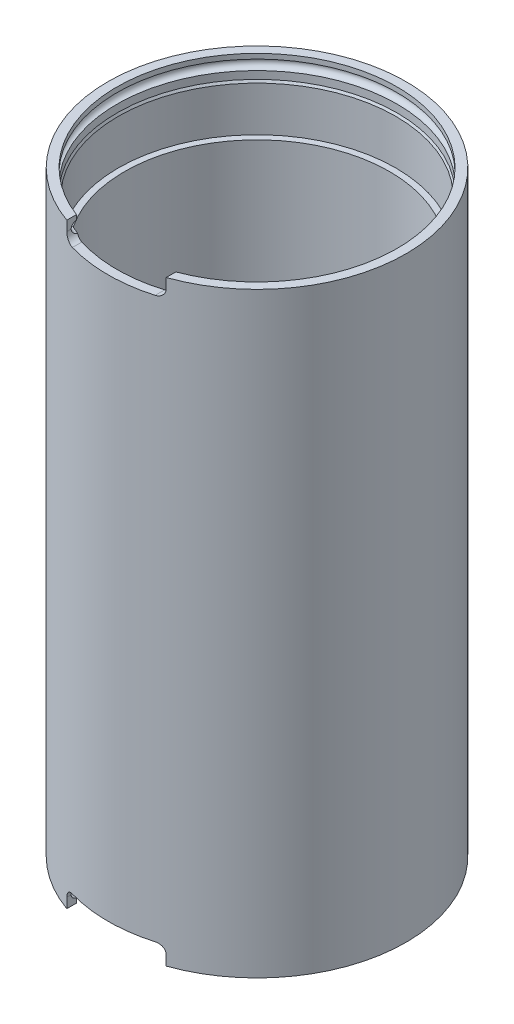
ISO-10303-21;
HEADER;
FILE_DESCRIPTION(('STEP AP214'),'2;1');
FILE_NAME('part.step','',(''),(''),'','','');
FILE_SCHEMA(('AUTOMOTIVE_DESIGN { 1 0 10303 214 1 1 1 1 }'));
ENDSEC;
DATA;
#1=APPLICATION_CONTEXT('core data for automotive mechanical design processes');
#2=APPLICATION_PROTOCOL_DEFINITION('international standard','automotive_design',2000,#1);
#3=PRODUCT_CONTEXT('',#1,'mechanical');
#4=PRODUCT('Part','Part','',(#3));
#5=PRODUCT_RELATED_PRODUCT_CATEGORY('part','',(#4));
#6=PRODUCT_DEFINITION_FORMATION('','',#4);
#7=PRODUCT_DEFINITION_CONTEXT('part definition',#1,'design');
#8=PRODUCT_DEFINITION('design','',#6,#7);
#9=PRODUCT_DEFINITION_SHAPE('','',#8);
#10=(LENGTH_UNIT() NAMED_UNIT(*) SI_UNIT(.MILLI.,.METRE.));
#11=(NAMED_UNIT(*) PLANE_ANGLE_UNIT() SI_UNIT($,.RADIAN.));
#12=(NAMED_UNIT(*) SI_UNIT($,.STERADIAN.) SOLID_ANGLE_UNIT());
#13=UNCERTAINTY_MEASURE_WITH_UNIT(LENGTH_MEASURE(1.E-05),#10,'distance_accuracy_value','');
#14=(GEOMETRIC_REPRESENTATION_CONTEXT(3) GLOBAL_UNCERTAINTY_ASSIGNED_CONTEXT((#13)) GLOBAL_UNIT_ASSIGNED_CONTEXT((#10,
#11,#12)) REPRESENTATION_CONTEXT('',''));
#15=CARTESIAN_POINT('',(0.,0.,0.));
#16=DIRECTION('',(0.,0.,1.));
#17=DIRECTION('',(1.,0.,0.));
#18=AXIS2_PLACEMENT_3D('',#15,#16,#17);
#19=CARTESIAN_POINT('',(0.,114.3,0.));
#20=DIRECTION('',(0.,-1.,0.));
#21=DIRECTION('',(0.,0.,-1.));
#22=AXIS2_PLACEMENT_3D('',#19,#20,#21);
#23=CYLINDRICAL_SURFACE('',#22,50.8);
#24=CARTESIAN_POINT('',(0.,87.63,0.));
#25=DIRECTION('',(0.,-1.,0.));
#26=DIRECTION('',(0.,0.,-1.));
#27=AXIS2_PLACEMENT_3D('',#24,#25,#26);
#28=CIRCLE('',#27,50.8);
#29=CARTESIAN_POINT('',(0.,87.63,-50.8));
#30=VERTEX_POINT('',#29);
#31=EDGE_CURVE('E317',#30,#30,#28,.T.);
#32=ORIENTED_EDGE('',*,*,#31,.F.);
#33=EDGE_LOOP('',(#32));
#34=FACE_BOUND('',#33,.T.);
#35=CARTESIAN_POINT('',(0.,-87.63,0.));
#36=DIRECTION('',(0.,-1.,0.));
#37=DIRECTION('',(0.,0.,-1.));
#38=AXIS2_PLACEMENT_3D('',#35,#36,#37);
#39=CIRCLE('',#38,50.8);
#40=CARTESIAN_POINT('',(0.,-87.63,-50.8));
#41=VERTEX_POINT('',#40);
#42=EDGE_CURVE('E175',#41,#41,#39,.T.);
#43=ORIENTED_EDGE('',*,*,#42,.T.);
#44=EDGE_LOOP('',(#43));
#45=FACE_BOUND('',#44,.T.);
#46=ADVANCED_FACE('F34',(#34,#45),#23,.F.);
#47=CARTESIAN_POINT('',(0.,114.3,0.));
#48=DIRECTION('',(0.,1.,0.));
#49=DIRECTION('',(0.,0.,1.));
#50=AXIS2_PLACEMENT_3D('',#47,#48,#49);
#51=PLANE('',#50);
#52=CARTESIAN_POINT('',(0.,114.3,0.));
#53=DIRECTION('',(0.,1.,0.));
#54=DIRECTION('',(0.,0.,1.));
#55=AXIS2_PLACEMENT_3D('',#52,#53,#54);
#56=CIRCLE('',#55,57.15);
#57=CARTESIAN_POINT('',(19.05,114.3,53.8815367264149));
#58=VERTEX_POINT('',#57);
#59=CARTESIAN_POINT('',(-19.05,114.3,53.8815367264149));
#60=VERTEX_POINT('',#59);
#61=EDGE_CURVE('E257',#58,#60,#56,.T.);
#62=ORIENTED_EDGE('',*,*,#61,.T.);
#63=DIRECTION('',(0.,0.,-1.));
#64=VECTOR('',#63,1.);
#65=CARTESIAN_POINT('',(-19.05,114.3,57.15));
#66=LINE('',#65,#64);
#67=CARTESIAN_POINT('',(-19.05,114.3,50.189154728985));
#68=VERTEX_POINT('',#67);
#69=EDGE_CURVE('E202',#60,#68,#66,.T.);
#70=ORIENTED_EDGE('',*,*,#69,.T.);
#71=CARTESIAN_POINT('',(0.,114.3,0.));
#72=DIRECTION('',(0.,-1.,0.));
#73=DIRECTION('',(0.,0.,-1.));
#74=AXIS2_PLACEMENT_3D('',#71,#72,#73);
#75=CIRCLE('',#74,53.6829);
#76=CARTESIAN_POINT('',(19.05,114.3,50.189154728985));
#77=VERTEX_POINT('',#76);
#78=EDGE_CURVE('E335',#68,#77,#75,.T.);
#79=ORIENTED_EDGE('',*,*,#78,.T.);
#80=DIRECTION('',(0.,0.,-1.));
#81=VECTOR('',#80,1.);
#82=CARTESIAN_POINT('',(19.05,114.3,57.15));
#83=LINE('',#82,#81);
#84=EDGE_CURVE('E205',#58,#77,#83,.T.);
#85=ORIENTED_EDGE('',*,*,#84,.F.);
#86=EDGE_LOOP('',(#62,#70,#79,#85));
#87=FACE_BOUND('',#86,.T.);
#88=ADVANCED_FACE('F341',(#87),#51,.T.);
#89=CARTESIAN_POINT('',(0.,114.3,0.));
#90=DIRECTION('',(0.,-1.,0.));
#91=DIRECTION('',(0.,0.,-1.));
#92=AXIS2_PLACEMENT_3D('',#89,#90,#91);
#93=CYLINDRICAL_SURFACE('',#92,57.15);
#94=CARTESIAN_POINT('',(15.875,-107.315,54.9008822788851));
#95=CARTESIAN_POINT('',(15.9679725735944,-107.315002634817,54.873999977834));
#96=CARTESIAN_POINT('',(16.0608296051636,-107.319085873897,54.8468920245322));
#97=CARTESIAN_POINT('',(16.2457464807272,-107.335353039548,54.7924035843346));
#98=CARTESIAN_POINT('',(16.3378063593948,-107.347536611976,54.7650231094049));
#99=CARTESIAN_POINT('',(16.6118128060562,-107.396122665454,54.6827796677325));
#100=CARTESIAN_POINT('',(16.7917309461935,-107.444560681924,54.6277727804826));
#101=CARTESIAN_POINT('',(17.1407625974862,-107.572283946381,54.5192651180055));
#102=CARTESIAN_POINT('',(17.3098705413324,-107.651584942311,54.465765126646));
#103=CARTESIAN_POINT('',(17.6323579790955,-107.839136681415,54.3622214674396));
#104=CARTESIAN_POINT('',(17.7857423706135,-107.947378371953,54.3121767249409));
#105=CARTESIAN_POINT('',(18.0702657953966,-108.188738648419,54.2181723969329));
#106=CARTESIAN_POINT('',(18.2016540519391,-108.321536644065,54.1741458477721));
#107=CARTESIAN_POINT('',(18.4400001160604,-108.609485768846,54.0934817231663));
#108=CARTESIAN_POINT('',(18.5469577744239,-108.7646370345,54.0568441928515));
#109=CARTESIAN_POINT('',(18.7281855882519,-109.085607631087,53.9943182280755));
#110=CARTESIAN_POINT('',(18.8037119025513,-109.25063078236,53.9680196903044));
#111=CARTESIAN_POINT('',(18.8952189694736,-109.506564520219,53.9360196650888));
#112=CARTESIAN_POINT('',(18.9220891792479,-109.593265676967,53.9265949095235));
#113=CARTESIAN_POINT('',(18.9683512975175,-109.768868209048,53.9103399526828));
#114=CARTESIAN_POINT('',(18.9877462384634,-109.85776867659,53.9035086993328));
#115=CARTESIAN_POINT('',(19.0188169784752,-110.036912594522,53.8925540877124));
#116=CARTESIAN_POINT('',(19.0305057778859,-110.127153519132,53.8884261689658));
#117=CARTESIAN_POINT('',(19.0460989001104,-110.308261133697,53.8829159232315));
#118=CARTESIAN_POINT('',(19.0500140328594,-110.399126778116,53.8815297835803));
#119=CARTESIAN_POINT('',(19.05,-110.49,53.8815367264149));
#120=B_SPLINE_CURVE_WITH_KNOTS('',3,(#94,#95,#96,#97,#98,#99,#100,#101,#102,#103,#104,#105,#106,
#107,#108,#109,#110,#111,#112,#113,#114,#115,#116,#117,#118,#119),.UNSPECIFIED.,.F.,.F.,(4,2,2,
2,2,2,2,2,2,2,2,2,4),(0.,0.290161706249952,0.580310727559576,1.16016237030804,1.74031027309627,
2.32027691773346,2.89314728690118,3.46602115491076,4.01307070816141,4.28653577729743,
4.5598897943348,4.83278147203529,5.10529340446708),.UNSPECIFIED.);
#121=CARTESIAN_POINT('',(15.875,-107.315,54.9008822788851));
#122=VERTEX_POINT('',#121);
#123=CARTESIAN_POINT('',(19.05,-110.49,53.8815367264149));
#124=VERTEX_POINT('',#123);
#125=EDGE_CURVE('E488',#122,#124,#120,.T.);
#126=ORIENTED_EDGE('',*,*,#125,.T.);
#127=DIRECTION('',(0.,-1.,0.));
#128=VECTOR('',#127,1.);
#129=CARTESIAN_POINT('',(19.05,114.3,53.8815367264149));
#130=LINE('',#129,#128);
#131=CARTESIAN_POINT('',(19.05,-114.3,53.8815367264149));
#132=VERTEX_POINT('',#131);
#133=EDGE_CURVE('E181',#124,#132,#130,.T.);
#134=ORIENTED_EDGE('',*,*,#133,.T.);
#135=CARTESIAN_POINT('',(0.,-114.3,0.));
#136=DIRECTION('',(0.,1.,0.));
#137=DIRECTION('',(0.,0.,1.));
#138=AXIS2_PLACEMENT_3D('',#135,#136,#137);
#139=CIRCLE('',#138,57.15);
#140=CARTESIAN_POINT('',(-19.05,-114.3,53.8815367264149));
#141=VERTEX_POINT('',#140);
#142=EDGE_CURVE('E174',#132,#141,#139,.T.);
#143=ORIENTED_EDGE('',*,*,#142,.T.);
#144=DIRECTION('',(0.,-1.,0.));
#145=VECTOR('',#144,1.);
#146=CARTESIAN_POINT('',(-19.05,114.3,53.8815367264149));
#147=LINE('',#146,#145);
#148=CARTESIAN_POINT('',(-19.05,-110.49,53.8815367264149));
#149=VERTEX_POINT('',#148);
#150=EDGE_CURVE('E165',#141,#149,#147,.F.);
#151=ORIENTED_EDGE('',*,*,#150,.T.);
#152=CARTESIAN_POINT('',(-19.05,-110.49,53.8815367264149));
#153=CARTESIAN_POINT('',(-19.0500111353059,-110.404201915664,53.88153121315));
#154=CARTESIAN_POINT('',(-19.0465224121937,-110.318409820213,53.882766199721));
#155=CARTESIAN_POINT('',(-19.0326310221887,-110.147472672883,53.8876753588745));
#156=CARTESIAN_POINT('',(-19.0222296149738,-110.062327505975,53.8913490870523));
#157=CARTESIAN_POINT('',(-18.994632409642,-109.893494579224,53.9010820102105));
#158=CARTESIAN_POINT('',(-18.9774533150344,-109.809803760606,53.9071353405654));
#159=CARTESIAN_POINT('',(-18.936481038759,-109.644282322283,53.921541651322));
#160=CARTESIAN_POINT('',(-18.9126877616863,-109.56245172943,53.929894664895));
#161=CARTESIAN_POINT('',(-18.8316921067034,-109.320633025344,53.958254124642));
#162=CARTESIAN_POINT('',(-18.7648437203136,-109.164135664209,53.9815717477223));
#163=CARTESIAN_POINT('',(-18.6078054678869,-108.864878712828,54.0359041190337));
#164=CARTESIAN_POINT('',(-18.5176078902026,-108.722123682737,54.0669214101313));
#165=CARTESIAN_POINT('',(-18.3140172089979,-108.450041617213,54.1362273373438));
#166=CARTESIAN_POINT('',(-18.2000728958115,-108.321170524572,54.1746868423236));
#167=CARTESIAN_POINT('',(-17.9539192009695,-108.084187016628,54.2567608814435));
#168=CARTESIAN_POINT('',(-17.82170430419,-107.976080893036,54.3003769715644));
#169=CARTESIAN_POINT('',(-17.5351767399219,-107.777736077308,54.393601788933));
#170=CARTESIAN_POINT('',(-17.3800659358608,-107.688742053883,54.4434053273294));
#171=CARTESIAN_POINT('',(-17.0577576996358,-107.538162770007,54.545246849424));
#172=CARTESIAN_POINT('',(-16.8905612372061,-107.476575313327,54.5972846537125));
#173=CARTESIAN_POINT('',(-16.5821415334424,-107.391468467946,54.6916417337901));
#174=CARTESIAN_POINT('',(-16.4422709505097,-107.362846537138,54.7338612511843));
#175=CARTESIAN_POINT('',(-16.1600050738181,-107.324608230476,54.817868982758));
#176=CARTESIAN_POINT('',(-16.0176128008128,-107.314970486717,54.8596576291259));
#177=CARTESIAN_POINT('',(-15.875,-107.315,54.9008822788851));
#178=B_SPLINE_CURVE_WITH_KNOTS('',3,(#152,#153,#154,#155,#156,#157,#158,#159,#160,#161,#162,
#163,#164,#165,#166,#167,#168,#169,#170,#171,#172,#173,#174,#175,#176,#177),.UNSPECIFIED.,.F.,
.F.,(4,2,2,2,2,2,2,2,2,2,2,2,4),(0.,0.257304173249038,0.514561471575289,0.771188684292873,
1.02781959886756,1.5405330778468,2.05341610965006,2.57988690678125,3.10651697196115,
3.66095105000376,4.21534069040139,4.66078488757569,5.10572742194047),.UNSPECIFIED.);
#179=CARTESIAN_POINT('',(-15.875,-107.315,54.9008822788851));
#180=VERTEX_POINT('',#179);
#181=EDGE_CURVE('E153',#149,#180,#178,.T.);
#182=ORIENTED_EDGE('',*,*,#181,.T.);
#183=CARTESIAN_POINT('',(0.,-107.315,0.));
#184=DIRECTION('',(0.,1.,0.));
#185=DIRECTION('',(0.,0.,1.));
#186=AXIS2_PLACEMENT_3D('',#183,#184,#185);
#187=CIRCLE('',#186,57.15);
#188=EDGE_CURVE('E161',#180,#122,#187,.T.);
#189=ORIENTED_EDGE('',*,*,#188,.T.);
#190=EDGE_LOOP('',(#126,#134,#143,#151,#182,#189));
#191=FACE_BOUND('',#190,.T.);
#192=CARTESIAN_POINT('',(0.,107.315,0.));
#193=DIRECTION('',(0.,1.,0.));
#194=DIRECTION('',(0.,0.,1.));
#195=AXIS2_PLACEMENT_3D('',#192,#193,#194);
#196=CIRCLE('',#195,57.15);
#197=CARTESIAN_POINT('',(-15.875,107.315,54.9008822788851));
#198=VERTEX_POINT('',#197);
#199=CARTESIAN_POINT('',(15.875,107.315,54.9008822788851));
#200=VERTEX_POINT('',#199);
#201=EDGE_CURVE('E300',#198,#200,#196,.T.);
#202=ORIENTED_EDGE('',*,*,#201,.F.);
#203=CARTESIAN_POINT('',(-19.05,110.49,53.8815367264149));
#204=CARTESIAN_POINT('',(-19.0500111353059,110.404201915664,53.88153121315));
#205=CARTESIAN_POINT('',(-19.0465224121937,110.318409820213,53.882766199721));
#206=CARTESIAN_POINT('',(-19.0326310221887,110.147472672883,53.8876753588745));
#207=CARTESIAN_POINT('',(-19.0222296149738,110.062327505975,53.8913490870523));
#208=CARTESIAN_POINT('',(-18.994632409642,109.893494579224,53.9010820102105));
#209=CARTESIAN_POINT('',(-18.9774533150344,109.809803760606,53.9071353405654));
#210=CARTESIAN_POINT('',(-18.936481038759,109.644282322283,53.921541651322));
#211=CARTESIAN_POINT('',(-18.9126877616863,109.56245172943,53.929894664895));
#212=CARTESIAN_POINT('',(-18.8316921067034,109.320633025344,53.958254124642));
#213=CARTESIAN_POINT('',(-18.7648437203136,109.164135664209,53.9815717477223));
#214=CARTESIAN_POINT('',(-18.6078054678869,108.864878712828,54.0359041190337));
#215=CARTESIAN_POINT('',(-18.5176078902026,108.722123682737,54.0669214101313));
#216=CARTESIAN_POINT('',(-18.3140172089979,108.450041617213,54.1362273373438));
#217=CARTESIAN_POINT('',(-18.2000728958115,108.321170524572,54.1746868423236));
#218=CARTESIAN_POINT('',(-17.9539192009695,108.084187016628,54.2567608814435));
#219=CARTESIAN_POINT('',(-17.82170430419,107.976080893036,54.3003769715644));
#220=CARTESIAN_POINT('',(-17.5351767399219,107.777736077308,54.393601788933));
#221=CARTESIAN_POINT('',(-17.3800659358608,107.688742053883,54.4434053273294));
#222=CARTESIAN_POINT('',(-17.0577576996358,107.538162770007,54.545246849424));
#223=CARTESIAN_POINT('',(-16.8905612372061,107.476575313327,54.5972846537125));
#224=CARTESIAN_POINT('',(-16.5821415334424,107.391468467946,54.6916417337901));
#225=CARTESIAN_POINT('',(-16.4422709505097,107.362846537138,54.7338612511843));
#226=CARTESIAN_POINT('',(-16.1600050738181,107.324608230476,54.817868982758));
#227=CARTESIAN_POINT('',(-16.0176128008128,107.314970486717,54.8596576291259));
#228=CARTESIAN_POINT('',(-15.875,107.315,54.9008822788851));
#229=B_SPLINE_CURVE_WITH_KNOTS('',3,(#203,#204,#205,#206,#207,#208,#209,#210,#211,#212,#213,
#214,#215,#216,#217,#218,#219,#220,#221,#222,#223,#224,#225,#226,#227,#228),.UNSPECIFIED.,.F.,
.F.,(4,2,2,2,2,2,2,2,2,2,2,2,4),(0.,0.257304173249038,0.514561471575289,0.771188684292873,
1.02781959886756,1.5405330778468,2.05341610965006,2.57988690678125,3.10651697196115,
3.66095105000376,4.21534069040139,4.66078488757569,5.10572742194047),.UNSPECIFIED.);
#230=CARTESIAN_POINT('',(-19.05,110.49,53.8815367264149));
#231=VERTEX_POINT('',#230);
#232=EDGE_CURVE('E299',#231,#198,#229,.T.);
#233=ORIENTED_EDGE('',*,*,#232,.F.);
#234=DIRECTION('',(0.,-1.,0.));
#235=VECTOR('',#234,1.);
#236=CARTESIAN_POINT('',(-19.05,114.3,53.8815367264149));
#237=LINE('',#236,#235);
#238=EDGE_CURVE('E315',#60,#231,#237,.T.);
#239=ORIENTED_EDGE('',*,*,#238,.F.);
#240=ORIENTED_EDGE('',*,*,#61,.F.);
#241=DIRECTION('',(0.,-1.,0.));
#242=VECTOR('',#241,1.);
#243=CARTESIAN_POINT('',(19.05,114.3,53.8815367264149));
#244=LINE('',#243,#242);
#245=CARTESIAN_POINT('',(19.05,110.49,53.8815367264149));
#246=VERTEX_POINT('',#245);
#247=EDGE_CURVE('E310',#246,#58,#244,.F.);
#248=ORIENTED_EDGE('',*,*,#247,.F.);
#249=CARTESIAN_POINT('',(15.875,107.315,54.9008822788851));
#250=CARTESIAN_POINT('',(15.9679725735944,107.315002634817,54.873999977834));
#251=CARTESIAN_POINT('',(16.0608296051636,107.319085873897,54.8468920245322));
#252=CARTESIAN_POINT('',(16.2457464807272,107.335353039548,54.7924035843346));
#253=CARTESIAN_POINT('',(16.3378063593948,107.347536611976,54.7650231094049));
#254=CARTESIAN_POINT('',(16.6118128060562,107.396122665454,54.6827796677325));
#255=CARTESIAN_POINT('',(16.7917309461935,107.444560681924,54.6277727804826));
#256=CARTESIAN_POINT('',(17.1407625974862,107.572283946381,54.5192651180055));
#257=CARTESIAN_POINT('',(17.3098705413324,107.651584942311,54.465765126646));
#258=CARTESIAN_POINT('',(17.6323579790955,107.839136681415,54.3622214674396));
#259=CARTESIAN_POINT('',(17.7857423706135,107.947378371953,54.3121767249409));
#260=CARTESIAN_POINT('',(18.0702657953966,108.188738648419,54.2181723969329));
#261=CARTESIAN_POINT('',(18.2016540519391,108.321536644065,54.1741458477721));
#262=CARTESIAN_POINT('',(18.4400001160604,108.609485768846,54.0934817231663));
#263=CARTESIAN_POINT('',(18.5469577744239,108.7646370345,54.0568441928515));
#264=CARTESIAN_POINT('',(18.7281855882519,109.085607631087,53.9943182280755));
#265=CARTESIAN_POINT('',(18.8037119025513,109.25063078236,53.9680196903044));
#266=CARTESIAN_POINT('',(18.8952189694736,109.506564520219,53.9360196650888));
#267=CARTESIAN_POINT('',(18.9220891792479,109.593265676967,53.9265949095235));
#268=CARTESIAN_POINT('',(18.9683512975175,109.768868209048,53.9103399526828));
#269=CARTESIAN_POINT('',(18.9877462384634,109.85776867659,53.9035086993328));
#270=CARTESIAN_POINT('',(19.0188169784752,110.036912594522,53.8925540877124));
#271=CARTESIAN_POINT('',(19.0305057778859,110.127153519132,53.8884261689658));
#272=CARTESIAN_POINT('',(19.0460989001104,110.308261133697,53.8829159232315));
#273=CARTESIAN_POINT('',(19.0500140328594,110.399126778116,53.8815297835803));
#274=CARTESIAN_POINT('',(19.05,110.49,53.8815367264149));
#275=B_SPLINE_CURVE_WITH_KNOTS('',3,(#249,#250,#251,#252,#253,#254,#255,#256,#257,#258,#259,
#260,#261,#262,#263,#264,#265,#266,#267,#268,#269,#270,#271,#272,#273,#274),.UNSPECIFIED.,.F.,
.F.,(4,2,2,2,2,2,2,2,2,2,2,2,4),(0.,0.290161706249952,0.580310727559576,1.16016237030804,
1.74031027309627,2.32027691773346,2.89314728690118,3.46602115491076,4.01307070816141,
4.28653577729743,4.5598897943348,4.83278147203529,5.10529340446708),.UNSPECIFIED.);
#276=EDGE_CURVE('E225',#200,#246,#275,.T.);
#277=ORIENTED_EDGE('',*,*,#276,.F.);
#278=EDGE_LOOP('',(#202,#233,#239,#240,#248,#277));
#279=FACE_BOUND('',#278,.T.);
#280=ADVANCED_FACE('F36',(#191,#279),#93,.T.);
#281=CARTESIAN_POINT('',(0.,-114.3,0.));
#282=DIRECTION('',(0.,-1.,0.));
#283=DIRECTION('',(0.,0.,-1.));
#284=AXIS2_PLACEMENT_3D('',#281,#282,#283);
#285=CYLINDRICAL_SURFACE('',#284,53.6829);
#286=ORIENTED_EDGE('',*,*,#78,.F.);
#287=DIRECTION('',(0.,-1.,0.));
#288=VECTOR('',#287,1.);
#289=CARTESIAN_POINT('',(-19.05,-114.3,50.189154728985));
#290=LINE('',#289,#288);
#291=CARTESIAN_POINT('',(-19.05,112.395,50.189154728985));
#292=VERTEX_POINT('',#291);
#293=EDGE_CURVE('E312',#68,#292,#290,.T.);
#294=ORIENTED_EDGE('',*,*,#293,.T.);
#295=CARTESIAN_POINT('',(0.,112.395,0.));
#296=DIRECTION('',(0.,-1.,0.));
#297=DIRECTION('',(0.,0.,-1.));
#298=AXIS2_PLACEMENT_3D('',#295,#296,#297);
#299=CIRCLE('',#298,53.6829);
#300=CARTESIAN_POINT('',(19.05,112.395,50.189154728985));
#301=VERTEX_POINT('',#300);
#302=EDGE_CURVE('E332',#292,#301,#299,.T.);
#303=ORIENTED_EDGE('',*,*,#302,.T.);
#304=DIRECTION('',(0.,-1.,0.));
#305=VECTOR('',#304,1.);
#306=CARTESIAN_POINT('',(19.05,-114.3,50.189154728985));
#307=LINE('',#306,#305);
#308=EDGE_CURVE('E307',#301,#77,#307,.F.);
#309=ORIENTED_EDGE('',*,*,#308,.T.);
#310=EDGE_LOOP('',(#286,#294,#303,#309));
#311=FACE_BOUND('',#310,.T.);
#312=ADVANCED_FACE('F452',(#311),#285,.F.);
#313=CARTESIAN_POINT('',(0.,110.49,0.));
#314=DIRECTION('',(0.,-1.,0.));
#315=DIRECTION('',(0.,0.,-1.));
#316=AXIS2_PLACEMENT_3D('',#313,#314,#315);
#317=TOROIDAL_SURFACE('',#316,53.6829,1.905);
#318=ORIENTED_EDGE('',*,*,#302,.F.);
#319=CARTESIAN_POINT('',(-19.05,110.871635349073,48.1876447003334));
#320=CARTESIAN_POINT('',(-19.05,110.97366708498,48.2100857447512));
#321=CARTESIAN_POINT('',(-19.05,111.073822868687,48.2415175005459));
#322=CARTESIAN_POINT('',(-19.05,111.267371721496,48.3210839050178));
#323=CARTESIAN_POINT('',(-19.05,111.360752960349,48.3692469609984));
#324=CARTESIAN_POINT('',(-19.05,111.537935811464,48.4802540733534));
#325=CARTESIAN_POINT('',(-19.05,111.621764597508,48.5430548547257));
#326=CARTESIAN_POINT('',(-19.05,111.778224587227,48.681243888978));
#327=CARTESIAN_POINT('',(-19.05,111.850858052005,48.7566295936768));
#328=CARTESIAN_POINT('',(-19.05,111.986524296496,48.9213443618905));
#329=CARTESIAN_POINT('',(-19.05,112.048982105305,49.011146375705));
#330=CARTESIAN_POINT('',(-19.05,112.159044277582,49.1994316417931));
#331=CARTESIAN_POINT('',(-19.05,112.206643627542,49.2979178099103));
#332=CARTESIAN_POINT('',(-19.05,112.288872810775,49.5078035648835));
#333=CARTESIAN_POINT('',(-19.05,112.322424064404,49.619626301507));
#334=CARTESIAN_POINT('',(-19.05,112.371168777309,49.847210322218));
#335=CARTESIAN_POINT('',(-19.05,112.386357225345,49.9629726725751));
#336=CARTESIAN_POINT('',(-19.05,112.398353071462,50.2005790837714));
#337=CARTESIAN_POINT('',(-19.05,112.394321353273,50.3224664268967));
#338=CARTESIAN_POINT('',(-19.05,112.365938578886,50.5638710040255));
#339=CARTESIAN_POINT('',(-19.05,112.341585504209,50.6833880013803));
#340=CARTESIAN_POINT('',(-19.05,112.272814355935,50.9169296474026));
#341=CARTESIAN_POINT('',(-19.05,112.228335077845,51.0309363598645));
#342=CARTESIAN_POINT('',(-19.05,112.120110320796,51.249432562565));
#343=CARTESIAN_POINT('',(-19.05,112.056368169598,51.353923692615));
#344=CARTESIAN_POINT('',(-19.05,111.91390111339,51.5458566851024));
#345=CARTESIAN_POINT('',(-19.05,111.835861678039,51.6338064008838));
#346=CARTESIAN_POINT('',(-19.05,111.665244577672,51.7942647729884));
#347=CARTESIAN_POINT('',(-19.05,111.572672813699,51.8667796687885));
#348=CARTESIAN_POINT('',(-19.05,111.381866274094,51.9894170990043));
#349=CARTESIAN_POINT('',(-19.05,111.284350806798,52.0406587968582));
#350=CARTESIAN_POINT('',(-19.05,111.081738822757,52.1249104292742));
#351=CARTESIAN_POINT('',(-19.05,110.976645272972,52.1579274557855));
#352=CARTESIAN_POINT('',(-19.05,110.768283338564,52.2030151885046));
#353=CARTESIAN_POINT('',(-19.05,110.665247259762,52.2161638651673));
#354=CARTESIAN_POINT('',(-19.05,110.458460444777,52.2244684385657));
#355=CARTESIAN_POINT('',(-19.05,110.354709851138,52.2196278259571));
#356=CARTESIAN_POINT('',(-19.05,110.152261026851,52.1925122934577));
#357=CARTESIAN_POINT('',(-19.05,110.053501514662,52.1706909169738));
#358=CARTESIAN_POINT('',(-19.05,109.860976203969,52.1109855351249));
#359=CARTESIAN_POINT('',(-19.05,109.767210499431,52.0731012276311));
#360=CARTESIAN_POINT('',(-19.05,109.585907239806,51.9820101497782));
#361=CARTESIAN_POINT('',(-19.05,109.498468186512,51.9286078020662));
#362=CARTESIAN_POINT('',(-19.05,109.333294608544,51.808480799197));
#363=CARTESIAN_POINT('',(-19.05,109.255561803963,51.7417537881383));
#364=CARTESIAN_POINT('',(-19.05,109.108187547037,51.5937333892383));
#365=CARTESIAN_POINT('',(-19.05,109.039071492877,51.5119174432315));
#366=CARTESIAN_POINT('',(-19.05,108.914623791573,51.3384103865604));
#367=CARTESIAN_POINT('',(-19.05,108.85929582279,51.2467166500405));
#368=CARTESIAN_POINT('',(-19.05,108.760464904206,51.0501398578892));
#369=CARTESIAN_POINT('',(-19.05,108.717881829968,50.9447942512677));
#370=CARTESIAN_POINT('',(-19.05,108.649981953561,50.7286797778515));
#371=CARTESIAN_POINT('',(-19.05,108.624669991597,50.6179094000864));
#372=CARTESIAN_POINT('',(-19.05,108.590771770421,50.3877110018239));
#373=CARTESIAN_POINT('',(-19.05,108.583162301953,50.2681384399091));
#374=CARTESIAN_POINT('',(-19.05,108.587587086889,50.0293437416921));
#375=CARTESIAN_POINT('',(-19.05,108.599625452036,49.9101216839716));
#376=CARTESIAN_POINT('',(-19.05,108.643660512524,49.6723275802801));
#377=CARTESIAN_POINT('',(-19.05,108.676146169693,49.5538454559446));
#378=CARTESIAN_POINT('',(-19.05,108.760918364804,49.3241613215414));
#379=CARTESIAN_POINT('',(-19.05,108.81320471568,49.2129592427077));
#380=CARTESIAN_POINT('',(-19.05,108.935355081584,49.0034688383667));
#381=CARTESIAN_POINT('',(-19.05,109.004865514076,48.9049749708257));
#382=CARTESIAN_POINT('',(-19.05,109.160384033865,48.7219871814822));
#383=CARTESIAN_POINT('',(-19.05,109.246385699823,48.6374878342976));
#384=CARTESIAN_POINT('',(-19.05,109.42711083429,48.4903811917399));
#385=CARTESIAN_POINT('',(-19.05,109.521022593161,48.426777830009));
#386=CARTESIAN_POINT('',(-19.05,109.718855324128,48.3176299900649));
#387=CARTESIAN_POINT('',(-19.05,109.822774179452,48.2720817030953));
#388=CARTESIAN_POINT('',(-19.05,110.02976176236,48.2036309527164));
#389=CARTESIAN_POINT('',(-19.05,110.132382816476,48.1793688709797));
#390=CARTESIAN_POINT('',(-19.05,110.340189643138,48.1493628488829));
#391=CARTESIAN_POINT('',(-19.05,110.445370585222,48.143586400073));
#392=CARTESIAN_POINT('',(-19.05,110.604197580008,48.1489683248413));
#393=CARTESIAN_POINT('',(-19.05,110.658157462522,48.1532857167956));
#394=CARTESIAN_POINT('',(-19.05,110.765457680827,48.1668134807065));
#395=CARTESIAN_POINT('',(-19.05,110.818798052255,48.1760235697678));
#396=CARTESIAN_POINT('',(-19.05,110.871635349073,48.1876447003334));
#397=B_SPLINE_CURVE_WITH_KNOTS('',3,(#319,#320,#321,#322,#323,#324,#325,#326,#327,#328,#329,
#330,#331,#332,#333,#334,#335,#336,#337,#338,#339,#340,#341,#342,#343,#344,#345,#346,#347,#348,
#349,#350,#351,#352,#353,#354,#355,#356,#357,#358,#359,#360,#361,#362,#363,#364,#365,#366,#367,
#368,#369,#370,#371,#372,#373,#374,#375,#376,#377,#378,#379,#380,#381,#382,#383,#384,#385,#386,
#387,#388,#389,#390,#391,#392,#393,#394,#395,#396),.UNSPECIFIED.,.T.,.F.,(4,2,2,2,2,2,2,2,2,2,2,
2,2,2,2,2,2,2,2,2,2,2,2,2,2,2,2,2,2,2,2,2,2,2,2,2,2,2,4),(0.,0.313199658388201,0.62693370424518,
0.939751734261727,1.25250650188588,1.57925485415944,1.90611333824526,2.25480286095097,
2.60358752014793,2.96773542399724,3.33191950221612,3.6972185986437,4.06245462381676,
4.41336979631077,4.76414284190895,5.09291610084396,5.42156133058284,5.73163997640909,
6.04165845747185,6.34366941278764,6.64568604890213,6.95168765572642,7.25774341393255,
7.57765025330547,7.89764234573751,8.23702760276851,8.57650793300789,8.93431659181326,
9.29220013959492,9.65898506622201,10.025766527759,10.3855654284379,10.7452245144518,
11.0837065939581,11.4221172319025,11.7368890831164,12.0511070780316,12.213307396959,
12.3754983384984),.UNSPECIFIED.);
#398=CARTESIAN_POINT('',(-19.05,110.49,52.221759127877));
#399=VERTEX_POINT('',#398);
#400=EDGE_CURVE('E354',#292,#399,#397,.T.);
#401=ORIENTED_EDGE('',*,*,#400,.T.);
#402=CARTESIAN_POINT('',(-19.0499999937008,110.4902,52.2217591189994));
#403=CARTESIAN_POINT('',(-19.0500131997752,110.437459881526,52.221766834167));
#404=CARTESIAN_POINT('',(-19.0486927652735,110.38472355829,52.2199165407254));
#405=CARTESIAN_POINT('',(-19.043458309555,110.279650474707,52.2125247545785));
#406=CARTESIAN_POINT('',(-19.0395448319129,110.227313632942,52.2069840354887));
#407=CARTESIAN_POINT('',(-19.0292110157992,110.123540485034,52.1922548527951));
#408=CARTESIAN_POINT('',(-19.0227970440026,110.072102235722,52.1830756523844));
#409=CARTESIAN_POINT('',(-19.0076118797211,109.970367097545,52.1611220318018));
#410=CARTESIAN_POINT('',(-18.9988406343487,109.920070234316,52.1483475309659));
#411=CARTESIAN_POINT('',(-18.9692614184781,109.771437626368,52.1047132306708));
#412=CARTESIAN_POINT('',(-18.9451754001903,109.675239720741,52.0685256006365));
#413=CARTESIAN_POINT('',(-18.8903455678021,109.491218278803,51.9824998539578));
#414=CARTESIAN_POINT('',(-18.8595976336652,109.403399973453,51.9326532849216));
#415=CARTESIAN_POINT('',(-18.7933986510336,109.236271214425,51.8184610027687));
#416=CARTESIAN_POINT('',(-18.7578523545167,109.157215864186,51.7537957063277));
#417=CARTESIAN_POINT('',(-18.6863027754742,109.012250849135,51.6112508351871));
#418=CARTESIAN_POINT('',(-18.6502994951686,108.946341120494,51.5333713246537));
#419=CARTESIAN_POINT('',(-18.5828916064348,108.830985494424,51.3671238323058));
#420=CARTESIAN_POINT('',(-18.5514061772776,108.78122236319,51.2790110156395));
#421=CARTESIAN_POINT('',(-18.4965194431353,108.698137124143,51.0931317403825));
#422=CARTESIAN_POINT('',(-18.473104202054,108.664786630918,50.995382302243));
#423=CARTESIAN_POINT('',(-18.4397717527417,108.618292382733,50.8062082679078));
#424=CARTESIAN_POINT('',(-18.428543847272,108.603160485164,50.7154953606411));
#425=CARTESIAN_POINT('',(-18.415447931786,108.585566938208,50.5321959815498));
#426=CARTESIAN_POINT('',(-18.4135849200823,108.583112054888,50.4396085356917));
#427=CARTESIAN_POINT('',(-18.4190959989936,108.590464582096,50.2335796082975));
#428=CARTESIAN_POINT('',(-18.4287296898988,108.603270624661,50.1203193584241));
#429=CARTESIAN_POINT('',(-18.4581776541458,108.643810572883,49.897769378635));
#430=CARTESIAN_POINT('',(-18.4780170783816,108.671581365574,49.7884901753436));
#431=CARTESIAN_POINT('',(-18.5166235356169,108.728412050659,49.612080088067));
#432=CARTESIAN_POINT('',(-18.5334481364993,108.753801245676,49.5432867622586));
#433=CARTESIAN_POINT('',(-18.5692659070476,108.809921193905,49.4084632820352));
#434=CARTESIAN_POINT('',(-18.5882598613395,108.840653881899,49.3424341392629));
#435=CARTESIAN_POINT('',(-18.6276594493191,108.907283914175,49.2134496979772));
#436=CARTESIAN_POINT('',(-18.6480655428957,108.943182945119,49.1504954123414));
#437=CARTESIAN_POINT('',(-18.6895791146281,109.020075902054,49.028065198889));
#438=CARTESIAN_POINT('',(-18.7106863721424,109.061068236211,48.9685881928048));
#439=CARTESIAN_POINT('',(-18.7657501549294,109.174611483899,48.818673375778));
#440=CARTESIAN_POINT('',(-18.7997530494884,109.251248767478,48.7312796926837));
#441=CARTESIAN_POINT('',(-18.8649565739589,109.418186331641,48.5695408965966));
#442=CARTESIAN_POINT('',(-18.8961629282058,109.508457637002,48.4951688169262));
#443=CARTESIAN_POINT('',(-18.9448723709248,109.67639924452,48.3816227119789));
#444=CARTESIAN_POINT('',(-18.9637994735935,109.750880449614,48.3383683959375));
#445=CARTESIAN_POINT('',(-18.996897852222,109.906342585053,48.2635459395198));
#446=CARTESIAN_POINT('',(-19.0110828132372,109.987303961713,48.2319441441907));
#447=CARTESIAN_POINT('',(-19.0311793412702,110.138178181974,48.1874250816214));
#448=CARTESIAN_POINT('',(-19.038156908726,110.207224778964,48.1720843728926));
#449=CARTESIAN_POINT('',(-19.0452219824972,110.312328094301,48.1565783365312));
#450=CARTESIAN_POINT('',(-19.0470103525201,110.347747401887,48.1526600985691));
#451=CARTESIAN_POINT('',(-19.0494024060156,110.418839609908,48.147422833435));
#452=CARTESIAN_POINT('',(-19.0500053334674,110.454512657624,48.1461054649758));
#453=CARTESIAN_POINT('',(-19.0499999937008,110.4902,48.1461154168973));
#454=B_SPLINE_CURVE_WITH_KNOTS('',3,(#402,#403,#404,#405,#406,#407,#408,#409,#410,#411,#412,
#413,#414,#415,#416,#417,#418,#419,#420,#421,#422,#423,#424,#425,#426,#427,#428,#429,#430,#431,
#432,#433,#434,#435,#436,#437,#438,#439,#440,#441,#442,#443,#444,#445,#446,#447,#448,#449,#450,
#451,#452,#453),.UNSPECIFIED.,.F.,.F.,(4,2,2,2,2,2,2,2,2,2,2,2,2,2,2,2,2,2,2,2,2,2,2,2,2,4),(0.,
0.158164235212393,0.31629532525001,0.474026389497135,0.631760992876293,0.946868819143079,
1.26217208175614,1.58505084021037,1.90792803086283,2.22401160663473,2.53954658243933,
2.81607922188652,3.09275943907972,3.43407627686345,3.77623831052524,4.00169097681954,
4.22722544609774,4.45283371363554,4.67837164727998,5.04038941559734,5.40164837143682,
5.66526164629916,5.92810747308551,6.14044751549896,6.24738428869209,6.35438923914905),.UNSPECIFIED.);
#455=CARTESIAN_POINT('',(-18.415,108.585,50.4256038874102));
#456=VERTEX_POINT('',#455);
#457=EDGE_CURVE('E293',#399,#456,#454,.T.);
#458=ORIENTED_EDGE('',*,*,#457,.T.);
#459=CARTESIAN_POINT('',(0.,108.585,0.));
#460=DIRECTION('',(0.,-1.,0.));
#461=DIRECTION('',(0.,0.,-1.));
#462=AXIS2_PLACEMENT_3D('',#459,#460,#461);
#463=CIRCLE('',#462,53.6829);
#464=CARTESIAN_POINT('',(18.415,108.585,50.4256038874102));
#465=VERTEX_POINT('',#464);
#466=EDGE_CURVE('E329',#456,#465,#463,.T.);
#467=ORIENTED_EDGE('',*,*,#466,.T.);
#468=CARTESIAN_POINT('',(19.0499999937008,110.4902,48.1461154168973));
#469=CARTESIAN_POINT('',(19.0500123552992,110.447061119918,48.1460928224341));
#470=CARTESIAN_POINT('',(19.0491265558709,110.403932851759,48.1480266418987));
#471=CARTESIAN_POINT('',(19.0456324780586,110.31812754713,48.1556781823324));
#472=CARTESIAN_POINT('',(19.0430260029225,110.275450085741,48.161391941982));
#473=CARTESIAN_POINT('',(19.0361996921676,110.191322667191,48.1763967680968));
#474=CARTESIAN_POINT('',(19.0319968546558,110.14986457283,48.185650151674));
#475=CARTESIAN_POINT('',(19.0221047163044,110.068030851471,48.2075154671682));
#476=CARTESIAN_POINT('',(19.0164151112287,110.02765544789,48.220128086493));
#477=CARTESIAN_POINT('',(18.997388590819,109.908872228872,48.262514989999));
#478=CARTESIAN_POINT('',(18.9820578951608,109.832392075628,48.2969162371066));
#479=CARTESIAN_POINT('',(18.9473860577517,109.685769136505,48.3759346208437));
#480=CARTESIAN_POINT('',(18.9280329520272,109.615646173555,48.4205822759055));
#481=CARTESIAN_POINT('',(18.8764679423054,109.449492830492,48.5420250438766));
#482=CARTESIAN_POINT('',(18.842607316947,109.357642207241,48.6238422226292));
#483=CARTESIAN_POINT('',(18.7726464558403,109.188986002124,48.8008783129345));
#484=CARTESIAN_POINT('',(18.736542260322,109.112208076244,48.8961213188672));
#485=CARTESIAN_POINT('',(18.6643095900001,108.971177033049,49.1000605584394));
#486=CARTESIAN_POINT('',(18.6282130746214,108.907370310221,49.2090753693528));
#487=CARTESIAN_POINT('',(18.5607759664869,108.795451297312,49.4362193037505));
#488=CARTESIAN_POINT('',(18.5294323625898,108.74732904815,49.5543425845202));
#489=CARTESIAN_POINT('',(18.4796835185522,108.673984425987,49.780234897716));
#490=CARTESIAN_POINT('',(18.4600529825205,108.646434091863,49.8869691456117));
#491=CARTESIAN_POINT('',(18.4304400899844,108.605586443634,50.1044361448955));
#492=CARTESIAN_POINT('',(18.4204409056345,108.592264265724,50.215161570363));
#493=CARTESIAN_POINT('',(18.4135915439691,108.583117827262,50.4181354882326));
#494=CARTESIAN_POINT('',(18.4147266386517,108.584612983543,50.5101841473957));
#495=CARTESIAN_POINT('',(18.426248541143,108.600064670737,50.6926457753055));
#496=CARTESIAN_POINT('',(18.4366280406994,108.614011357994,50.7830599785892));
#497=CARTESIAN_POINT('',(18.4660810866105,108.654912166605,50.959596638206));
#498=CARTESIAN_POINT('',(18.4851700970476,108.681889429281,51.0457111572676));
#499=CARTESIAN_POINT('',(18.5300514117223,108.748470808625,51.2110612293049));
#500=CARTESIAN_POINT('',(18.5558486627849,108.788084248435,51.2902916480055));
#501=CARTESIAN_POINT('',(18.6109742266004,108.878227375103,51.4391594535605));
#502=CARTESIAN_POINT('',(18.640247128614,108.928593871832,51.5089172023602));
#503=CARTESIAN_POINT('',(18.6999214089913,109.0393444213,51.6393800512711));
#504=CARTESIAN_POINT('',(18.730323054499,109.099730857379,51.7000829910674));
#505=CARTESIAN_POINT('',(18.7935277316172,109.237312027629,51.8189369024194));
#506=CARTESIAN_POINT('',(18.8261625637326,109.315661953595,51.8758431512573));
#507=CARTESIAN_POINT('',(18.8869280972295,109.481667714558,51.9772239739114));
#508=CARTESIAN_POINT('',(18.9150558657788,109.5693295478,52.0216904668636));
#509=CARTESIAN_POINT('',(18.9660130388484,109.757634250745,52.1000560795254));
#510=CARTESIAN_POINT('',(18.9884006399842,109.858746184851,52.133119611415));
#511=CARTESIAN_POINT('',(19.0233493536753,110.066271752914,52.1840074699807));
#512=CARTESIAN_POINT('',(19.0359270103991,110.172676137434,52.2018574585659));
#513=CARTESIAN_POINT('',(19.0453652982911,110.314935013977,52.2152175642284));
#514=CARTESIAN_POINT('',(19.0471045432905,110.349948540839,52.2176746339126));
#515=CARTESIAN_POINT('',(19.0494215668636,110.420036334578,52.2209448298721));
#516=CARTESIAN_POINT('',(19.0500011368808,110.45511042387,52.2217604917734));
#517=CARTESIAN_POINT('',(19.0499999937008,110.4902,52.2217591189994));
#518=B_SPLINE_CURVE_WITH_KNOTS('',3,(#468,#469,#470,#471,#472,#473,#474,#475,#476,#477,#478,
#479,#480,#481,#482,#483,#484,#485,#486,#487,#488,#489,#490,#491,#492,#493,#494,#495,#496,#497,
#498,#499,#500,#501,#502,#503,#504,#505,#506,#507,#508,#509,#510,#511,#512,#513,#514,#515,#516,
#517),.UNSPECIFIED.,.F.,.F.,(4,2,2,2,2,2,2,2,2,2,2,2,2,2,2,2,2,2,2,2,2,2,2,2,4),(0.,
0.129346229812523,0.258557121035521,0.386429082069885,0.51432722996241,0.76886839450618,
1.02417776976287,1.40481423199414,1.78614270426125,2.17894552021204,2.57149843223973,
2.90627634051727,3.24046825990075,3.51548670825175,3.79028793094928,4.06557898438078,
4.3410736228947,4.61265185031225,4.88429476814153,5.18954280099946,5.49498866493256,
5.8195519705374,6.14356671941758,6.2489529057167,6.35417616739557),.UNSPECIFIED.);
#519=CARTESIAN_POINT('',(19.05,110.49,52.221759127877));
#520=VERTEX_POINT('',#519);
#521=EDGE_CURVE('E63',#465,#520,#518,.T.);
#522=ORIENTED_EDGE('',*,*,#521,.T.);
#523=CARTESIAN_POINT('',(19.05,110.871635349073,48.1876447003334));
#524=CARTESIAN_POINT('',(19.05,110.773828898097,48.1661442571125));
#525=CARTESIAN_POINT('',(19.05,110.674147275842,48.1528684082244));
#526=CARTESIAN_POINT('',(19.05,110.473909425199,48.1433503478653));
#527=CARTESIAN_POINT('',(19.05,110.373352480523,48.1471237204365));
#528=CARTESIAN_POINT('',(19.05,110.174394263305,48.1715616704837));
#529=CARTESIAN_POINT('',(19.05,110.075991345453,48.1922128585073));
#530=CARTESIAN_POINT('',(19.05,109.884013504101,48.2495651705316));
#531=CARTESIAN_POINT('',(19.05,109.790438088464,48.286264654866));
#532=CARTESIAN_POINT('',(19.05,109.609486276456,48.374841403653));
#533=CARTESIAN_POINT('',(19.05,109.522191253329,48.4268844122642));
#534=CARTESIAN_POINT('',(19.05,109.357001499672,48.5441860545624));
#535=CARTESIAN_POINT('',(19.05,109.279108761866,48.6094474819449));
#536=CARTESIAN_POINT('',(19.05,109.130453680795,48.7549523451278));
#537=CARTESIAN_POINT('',(19.05,109.060291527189,48.8358083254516));
#538=CARTESIAN_POINT('',(19.05,108.933508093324,49.0075085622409));
#539=CARTESIAN_POINT('',(19.05,108.876890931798,49.0983558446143));
#540=CARTESIAN_POINT('',(19.05,108.774805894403,49.2940221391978));
#541=CARTESIAN_POINT('',(19.05,108.7303523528,49.3993706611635));
#542=CARTESIAN_POINT('',(19.05,108.658725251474,49.6157877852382));
#543=CARTESIAN_POINT('',(19.05,108.631556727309,49.7268580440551));
#544=CARTESIAN_POINT('',(19.05,108.593953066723,49.9580129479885));
#545=CARTESIAN_POINT('',(19.05,108.584507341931,50.078259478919));
#546=CARTESIAN_POINT('',(19.05,108.585532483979,50.3186829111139));
#547=CARTESIAN_POINT('',(19.05,108.596006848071,50.4388597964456));
#548=CARTESIAN_POINT('',(19.05,108.637138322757,50.6779805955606));
#549=CARTESIAN_POINT('',(19.05,108.668157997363,50.7968626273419));
#550=CARTESIAN_POINT('',(19.05,108.750237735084,51.0275201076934));
#551=CARTESIAN_POINT('',(19.05,108.801296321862,51.1392960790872));
#552=CARTESIAN_POINT('',(19.05,108.920857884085,51.3492745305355));
#553=CARTESIAN_POINT('',(19.05,108.9888719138,51.4477546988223));
#554=CARTESIAN_POINT('',(19.05,109.14140707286,51.6309957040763));
#555=CARTESIAN_POINT('',(19.05,109.225922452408,51.715761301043));
#556=CARTESIAN_POINT('',(19.05,109.403863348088,51.8638163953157));
#557=CARTESIAN_POINT('',(19.05,109.496490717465,51.9280645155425));
#558=CARTESIAN_POINT('',(19.05,109.691779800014,52.0388852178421));
#559=CARTESIAN_POINT('',(19.05,109.794437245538,52.0854652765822));
#560=CARTESIAN_POINT('',(19.05,109.999982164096,52.1566864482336));
#561=CARTESIAN_POINT('',(19.05,110.102461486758,52.182507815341));
#562=CARTESIAN_POINT('',(19.05,110.31035167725,52.215818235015));
#563=CARTESIAN_POINT('',(19.05,110.415761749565,52.2233122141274));
#564=CARTESIAN_POINT('',(19.05,110.622233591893,52.2197383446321));
#565=CARTESIAN_POINT('',(19.05,110.723308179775,52.2093660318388));
#566=CARTESIAN_POINT('',(19.05,110.922266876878,52.1717880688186));
#567=CARTESIAN_POINT('',(19.05,111.020151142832,52.1445832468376));
#568=CARTESIAN_POINT('',(19.05,111.210056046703,52.0743473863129));
#569=CARTESIAN_POINT('',(19.05,111.302076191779,52.0313150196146));
#570=CARTESIAN_POINT('',(19.05,111.477924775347,51.9309264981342));
#571=CARTESIAN_POINT('',(19.05,111.561752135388,51.8735684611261));
#572=CARTESIAN_POINT('',(19.05,111.722135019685,51.7440805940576));
#573=CARTESIAN_POINT('',(19.05,111.798321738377,51.6714946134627));
#574=CARTESIAN_POINT('',(19.05,111.93823536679,51.5151848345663));
#575=CARTESIAN_POINT('',(19.05,112.001959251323,51.4314583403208));
#576=CARTESIAN_POINT('',(19.05,112.119056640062,51.2501219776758));
#577=CARTESIAN_POINT('',(19.05,112.171621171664,51.1519898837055));
#578=CARTESIAN_POINT('',(19.05,112.260579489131,50.9486559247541));
#579=CARTESIAN_POINT('',(19.05,112.296968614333,50.8434520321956));
#580=CARTESIAN_POINT('',(19.05,112.354682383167,50.6223524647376));
#581=CARTESIAN_POINT('',(19.05,112.374994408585,50.5061919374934));
#582=CARTESIAN_POINT('',(19.05,112.396599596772,50.2721078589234));
#583=CARTESIAN_POINT('',(19.05,112.397888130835,50.1541838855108));
#584=CARTESIAN_POINT('',(19.05,112.381162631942,49.9153022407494));
#585=CARTESIAN_POINT('',(19.05,112.362431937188,49.7943939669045));
#586=CARTESIAN_POINT('',(19.05,112.304886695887,49.5574351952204));
#587=CARTESIAN_POINT('',(19.05,112.266071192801,49.441384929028));
#588=CARTESIAN_POINT('',(19.05,112.169252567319,49.2180457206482));
#589=CARTESIAN_POINT('',(19.05,112.111318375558,49.1107270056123));
#590=CARTESIAN_POINT('',(19.05,111.977387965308,48.9079450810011));
#591=CARTESIAN_POINT('',(19.05,111.901391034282,48.812482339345));
#592=CARTESIAN_POINT('',(19.05,111.737140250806,48.6411754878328));
#593=CARTESIAN_POINT('',(19.05,111.649626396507,48.5646223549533));
#594=CARTESIAN_POINT('',(19.05,111.462236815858,48.4287373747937));
#595=CARTESIAN_POINT('',(19.05,111.36238475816,48.3693732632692));
#596=CARTESIAN_POINT('',(19.05,111.196293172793,48.2907140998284));
#597=CARTESIAN_POINT('',(19.05,111.133037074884,48.264966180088));
#598=CARTESIAN_POINT('',(19.05,111.004022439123,48.2207549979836));
#599=CARTESIAN_POINT('',(19.05,110.938264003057,48.2022914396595));
#600=CARTESIAN_POINT('',(19.05,110.871635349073,48.1876447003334));
#601=B_SPLINE_CURVE_WITH_KNOTS('',3,(#523,#524,#525,#526,#527,#528,#529,#530,#531,#532,#533,
#534,#535,#536,#537,#538,#539,#540,#541,#542,#543,#544,#545,#546,#547,#548,#549,#550,#551,#552,
#553,#554,#555,#556,#557,#558,#559,#560,#561,#562,#563,#564,#565,#566,#567,#568,#569,#570,#571,
#572,#573,#574,#575,#576,#577,#578,#579,#580,#581,#582,#583,#584,#585,#586,#587,#588,#589,#590,
#591,#592,#593,#594,#595,#596,#597,#598,#599,#600),.UNSPECIFIED.,.T.,.F.,(4,2,2,2,2,2,2,2,2,2,2,
2,2,2,2,2,2,2,2,2,2,2,2,2,2,2,2,2,2,2,2,2,2,2,2,2,2,2,4),(0.,0.300175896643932,
0.600626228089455,0.900838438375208,1.20101998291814,1.50457101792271,1.80818627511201,
2.12796169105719,2.44783422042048,2.78936271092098,3.13099065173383,3.4911808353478,
3.85143426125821,4.21822078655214,4.58498029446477,4.94218807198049,5.29927160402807,
5.63570063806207,5.97198714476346,6.2874427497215,6.60281354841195,6.90618259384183,
7.20953671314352,7.51291629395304,7.81633575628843,8.13064133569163,8.44502311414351,
8.7775376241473,9.11014788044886,9.4623330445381,9.81460389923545,10.1799215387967,
10.5452565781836,10.9092885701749,11.2733349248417,11.62034536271,11.966700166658,
12.1711971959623,12.3756859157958),.UNSPECIFIED.);
#602=EDGE_CURVE('E276',#520,#301,#601,.T.);
#603=ORIENTED_EDGE('',*,*,#602,.T.);
#604=EDGE_LOOP('',(#318,#401,#458,#467,#522,#603));
#605=FACE_BOUND('',#604,.T.);
#606=ADVANCED_FACE('F231',(#605),#317,.F.);
#607=CARTESIAN_POINT('',(0.,-114.3,0.));
#608=DIRECTION('',(0.,-1.,0.));
#609=DIRECTION('',(0.,0.,-1.));
#610=AXIS2_PLACEMENT_3D('',#607,#608,#609);
#611=CYLINDRICAL_SURFACE('',#610,53.6829);
#612=CARTESIAN_POINT('',(0.,105.654881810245,0.));
#613=DIRECTION('',(0.,-1.,0.));
#614=DIRECTION('',(0.,0.,-1.));
#615=AXIS2_PLACEMENT_3D('',#612,#613,#614);
#616=CIRCLE('',#615,53.6829);
#617=CARTESIAN_POINT('',(0.,105.654881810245,-53.6829));
#618=VERTEX_POINT('',#617);
#619=EDGE_CURVE('E326',#618,#618,#616,.T.);
#620=ORIENTED_EDGE('',*,*,#619,.T.);
#621=EDGE_LOOP('',(#620));
#622=FACE_BOUND('',#621,.T.);
#623=ORIENTED_EDGE('',*,*,#466,.F.);
#624=CARTESIAN_POINT('',(-18.415,108.585,50.4256038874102));
#625=CARTESIAN_POINT('',(-18.3596145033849,108.511139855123,50.4458306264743));
#626=CARTESIAN_POINT('',(-18.3011404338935,108.439897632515,50.4670810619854));
#627=CARTESIAN_POINT('',(-18.1785615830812,108.30307288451,50.5113639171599));
#628=CARTESIAN_POINT('',(-18.114458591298,108.23748857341,50.5343957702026));
#629=CARTESIAN_POINT('',(-17.9812573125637,108.112473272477,50.5819446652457));
#630=CARTESIAN_POINT('',(-17.9121685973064,108.053030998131,50.6064588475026));
#631=CARTESIAN_POINT('',(-17.7694512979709,107.94050081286,50.6567477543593));
#632=CARTESIAN_POINT('',(-17.6958224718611,107.887413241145,50.6825225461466));
#633=CARTESIAN_POINT('',(-17.4690446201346,107.738215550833,50.7613210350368));
#634=CARTESIAN_POINT('',(-17.309790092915,107.651970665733,50.8158956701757));
#635=CARTESIAN_POINT('',(-16.9796844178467,107.507928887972,50.9271480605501));
#636=CARTESIAN_POINT('',(-16.808834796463,107.450128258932,50.9838255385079));
#637=CARTESIAN_POINT('',(-16.5103127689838,107.37658429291,51.0811155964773));
#638=CARTESIAN_POINT('',(-16.3843743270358,107.353522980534,51.1216543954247));
#639=CARTESIAN_POINT('',(-16.1306896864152,107.322733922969,51.2022705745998));
#640=CARTESIAN_POINT('',(-16.0029462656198,107.314984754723,51.2423485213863));
#641=CARTESIAN_POINT('',(-15.875,107.315,51.2819473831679));
#642=B_SPLINE_CURVE_WITH_KNOTS('',3,(#624,#625,#626,#627,#628,#629,#630,#631,#632,#633,#634,
#635,#636,#637,#638,#639,#640,#641),.UNSPECIFIED.,.F.,.F.,(4,2,2,2,2,2,2,2,4),(0.,
0.283410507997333,0.566731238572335,0.84952181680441,1.13232748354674,1.69704173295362,
2.26168178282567,2.66372542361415,3.0652061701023),.UNSPECIFIED.);
#643=CARTESIAN_POINT('',(-15.875,107.315,51.2819473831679));
#644=VERTEX_POINT('',#643);
#645=EDGE_CURVE('E269',#456,#644,#642,.T.);
#646=ORIENTED_EDGE('',*,*,#645,.T.);
#647=CARTESIAN_POINT('',(0.,107.315,0.));
#648=DIRECTION('',(0.,1.,0.));
#649=DIRECTION('',(0.,0.,1.));
#650=AXIS2_PLACEMENT_3D('',#647,#648,#649);
#651=CIRCLE('',#650,53.6829);
#652=CARTESIAN_POINT('',(15.875,107.315,51.2819473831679));
#653=VERTEX_POINT('',#652);
#654=EDGE_CURVE('E256',#644,#653,#651,.T.);
#655=ORIENTED_EDGE('',*,*,#654,.T.);
#656=CARTESIAN_POINT('',(15.875,107.315,51.2819473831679));
#657=CARTESIAN_POINT('',(15.9684343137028,107.314993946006,51.2530262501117));
#658=CARTESIAN_POINT('',(16.0617817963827,107.319124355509,51.2238468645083));
#659=CARTESIAN_POINT('',(16.2476575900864,107.33556714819,51.1651912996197));
#660=CARTESIAN_POINT('',(16.340185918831,107.34787935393,51.1357151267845));
#661=CARTESIAN_POINT('',(16.523899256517,107.380615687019,51.0766467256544));
#662=CARTESIAN_POINT('',(16.6150823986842,107.401050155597,51.0470543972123));
#663=CARTESIAN_POINT('',(16.7953188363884,107.449874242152,50.9880380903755));
#664=CARTESIAN_POINT('',(16.8843721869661,107.478263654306,50.9586141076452));
#665=CARTESIAN_POINT('',(17.1475356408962,107.575178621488,50.870913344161));
#666=CARTESIAN_POINT('',(17.3176700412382,107.655454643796,50.8132010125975));
#667=CARTESIAN_POINT('',(17.6416989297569,107.845270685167,50.7016133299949));
#668=CARTESIAN_POINT('',(17.7956229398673,107.954756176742,50.6477310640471));
#669=CARTESIAN_POINT('',(18.0269181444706,108.152641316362,50.5657265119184));
#670=CARTESIAN_POINT('',(18.1108219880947,108.232743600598,50.5357200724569));
#671=CARTESIAN_POINT('',(18.2697890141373,108.402150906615,50.4784678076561));
#672=CARTESIAN_POINT('',(18.3448531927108,108.491454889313,50.4512216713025));
#673=CARTESIAN_POINT('',(18.415,108.585,50.4256038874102));
#674=B_SPLINE_CURVE_WITH_KNOTS('',3,(#656,#657,#658,#659,#660,#661,#662,#663,#664,#665,#666,
#667,#668,#669,#670,#671,#672,#673),.UNSPECIFIED.,.F.,.F.,(4,2,2,2,2,2,2,2,4),(0.,
0.293325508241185,0.586644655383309,0.880338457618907,1.1740246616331,1.76133110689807,
2.34754876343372,2.70634804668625,3.06510685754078),.UNSPECIFIED.);
#675=EDGE_CURVE('E249',#653,#465,#674,.T.);
#676=ORIENTED_EDGE('',*,*,#675,.T.);
#677=EDGE_LOOP('',(#623,#646,#655,#676));
#678=FACE_BOUND('',#677,.T.);
#679=ADVANCED_FACE('F260',(#622,#678),#611,.F.);
#680=CARTESIAN_POINT('',(0.,-114.3,0.));
#681=DIRECTION('',(0.,1.,0.));
#682=DIRECTION('',(0.,0.,1.));
#683=AXIS2_PLACEMENT_3D('',#680,#681,#682);
#684=PLANE('',#683);
#685=CARTESIAN_POINT('',(0.,-114.3,0.));
#686=DIRECTION('',(0.,-1.,0.));
#687=DIRECTION('',(0.,0.,-1.));
#688=AXIS2_PLACEMENT_3D('',#685,#686,#687);
#689=CIRCLE('',#688,53.6829);
#690=CARTESIAN_POINT('',(-19.05,-114.3,50.189154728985));
#691=VERTEX_POINT('',#690);
#692=CARTESIAN_POINT('',(19.05,-114.3,50.189154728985));
#693=VERTEX_POINT('',#692);
#694=EDGE_CURVE('E199',#691,#693,#689,.T.);
#695=ORIENTED_EDGE('',*,*,#694,.F.);
#696=DIRECTION('',(0.,0.,-1.));
#697=VECTOR('',#696,1.);
#698=CARTESIAN_POINT('',(-19.05,-114.3,57.15));
#699=LINE('',#698,#697);
#700=EDGE_CURVE('E392',#141,#691,#699,.T.);
#701=ORIENTED_EDGE('',*,*,#700,.F.);
#702=ORIENTED_EDGE('',*,*,#142,.F.);
#703=DIRECTION('',(0.,0.,-1.));
#704=VECTOR('',#703,1.);
#705=CARTESIAN_POINT('',(19.05,-114.3,57.15));
#706=LINE('',#705,#704);
#707=EDGE_CURVE('E462',#132,#693,#706,.T.);
#708=ORIENTED_EDGE('',*,*,#707,.T.);
#709=EDGE_LOOP('',(#695,#701,#702,#708));
#710=FACE_BOUND('',#709,.T.);
#711=ADVANCED_FACE('F264',(#710),#684,.F.);
#712=CARTESIAN_POINT('',(0.,105.654881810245,0.));
#713=DIRECTION('',(0.,1.,0.));
#714=DIRECTION('',(0.,0.,1.));
#715=AXIS2_PLACEMENT_3D('',#712,#713,#714);
#716=CONICAL_SURFACE('',#715,53.6829,0.52359877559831);
#717=CARTESIAN_POINT('',(0.,104.775,0.));
#718=DIRECTION('',(0.,-1.,0.));
#719=DIRECTION('',(0.,0.,-1.));
#720=AXIS2_PLACEMENT_3D('',#717,#718,#719);
#721=CIRCLE('',#720,53.1749);
#722=CARTESIAN_POINT('',(0.,104.775,-53.1749));
#723=VERTEX_POINT('',#722);
#724=EDGE_CURVE('E323',#723,#723,#721,.T.);
#725=ORIENTED_EDGE('',*,*,#724,.T.);
#726=EDGE_LOOP('',(#725));
#727=FACE_BOUND('',#726,.T.);
#728=ORIENTED_EDGE('',*,*,#619,.F.);
#729=EDGE_LOOP('',(#728));
#730=FACE_BOUND('',#729,.T.);
#731=ADVANCED_FACE('F266',(#727,#730),#716,.F.);
#732=CARTESIAN_POINT('',(0.,-114.3,0.));
#733=DIRECTION('',(0.,-1.,0.));
#734=DIRECTION('',(0.,0.,-1.));
#735=AXIS2_PLACEMENT_3D('',#732,#733,#734);
#736=CYLINDRICAL_SURFACE('',#735,53.1749);
#737=CARTESIAN_POINT('',(0.,87.63,0.));
#738=DIRECTION('',(0.,-1.,0.));
#739=DIRECTION('',(0.,0.,-1.));
#740=AXIS2_PLACEMENT_3D('',#737,#738,#739);
#741=CIRCLE('',#740,53.1749);
#742=CARTESIAN_POINT('',(0.,87.63,-53.1749));
#743=VERTEX_POINT('',#742);
#744=EDGE_CURVE('E320',#743,#743,#741,.T.);
#745=ORIENTED_EDGE('',*,*,#744,.T.);
#746=EDGE_LOOP('',(#745));
#747=FACE_BOUND('',#746,.T.);
#748=ORIENTED_EDGE('',*,*,#724,.F.);
#749=EDGE_LOOP('',(#748));
#750=FACE_BOUND('',#749,.T.);
#751=ADVANCED_FACE('F458',(#747,#750),#736,.F.);
#752=CARTESIAN_POINT('',(-53.1749,87.63,0.));
#753=DIRECTION('',(0.,1.,0.));
#754=DIRECTION('',(0.,0.,1.));
#755=AXIS2_PLACEMENT_3D('',#752,#753,#754);
#756=PLANE('',#755);
#757=ORIENTED_EDGE('',*,*,#31,.T.);
#758=EDGE_LOOP('',(#757));
#759=FACE_BOUND('',#758,.T.);
#760=ORIENTED_EDGE('',*,*,#744,.F.);
#761=EDGE_LOOP('',(#760));
#762=FACE_BOUND('',#761,.T.);
#763=ADVANCED_FACE('F593',(#759,#762),#756,.T.);
#764=CARTESIAN_POINT('',(-19.05,114.3,57.15));
#765=DIRECTION('',(1.,0.,0.));
#766=DIRECTION('',(0.,0.,-1.));
#767=AXIS2_PLACEMENT_3D('',#764,#765,#766);
#768=PLANE('',#767);
#769=ORIENTED_EDGE('',*,*,#238,.T.);
#770=DIRECTION('',(0.,0.,-1.));
#771=VECTOR('',#770,1.);
#772=CARTESIAN_POINT('',(-19.05,110.49,57.15));
#773=LINE('',#772,#771);
#774=EDGE_CURVE('E215',#231,#399,#773,.T.);
#775=ORIENTED_EDGE('',*,*,#774,.T.);
#776=ORIENTED_EDGE('',*,*,#400,.F.);
#777=ORIENTED_EDGE('',*,*,#293,.F.);
#778=ORIENTED_EDGE('',*,*,#69,.F.);
#779=EDGE_LOOP('',(#769,#775,#776,#777,#778));
#780=FACE_BOUND('',#779,.T.);
#781=ADVANCED_FACE('F286',(#780),#768,.T.);
#782=CARTESIAN_POINT('',(19.05,114.3,57.15));
#783=DIRECTION('',(-1.,0.,0.));
#784=DIRECTION('',(0.,0.,1.));
#785=AXIS2_PLACEMENT_3D('',#782,#783,#784);
#786=PLANE('',#785);
#787=ORIENTED_EDGE('',*,*,#247,.T.);
#788=ORIENTED_EDGE('',*,*,#84,.T.);
#789=ORIENTED_EDGE('',*,*,#308,.F.);
#790=ORIENTED_EDGE('',*,*,#602,.F.);
#791=DIRECTION('',(0.,0.,-1.));
#792=VECTOR('',#791,1.);
#793=CARTESIAN_POINT('',(19.05,110.49,57.15));
#794=LINE('',#793,#792);
#795=EDGE_CURVE('E207',#246,#520,#794,.T.);
#796=ORIENTED_EDGE('',*,*,#795,.F.);
#797=EDGE_LOOP('',(#787,#788,#789,#790,#796));
#798=FACE_BOUND('',#797,.T.);
#799=ADVANCED_FACE('F242',(#798),#786,.T.);
#800=CARTESIAN_POINT('',(-15.875,110.49,57.15));
#801=DIRECTION('',(0.,0.,-1.));
#802=DIRECTION('',(-1.,0.,0.));
#803=AXIS2_PLACEMENT_3D('',#800,#801,#802);
#804=CYLINDRICAL_SURFACE('',#803,3.175);
#805=ORIENTED_EDGE('',*,*,#232,.T.);
#806=DIRECTION('',(0.,0.,-1.));
#807=VECTOR('',#806,1.);
#808=CARTESIAN_POINT('',(-15.875,107.315,57.15));
#809=LINE('',#808,#807);
#810=EDGE_CURVE('E212',#198,#644,#809,.T.);
#811=ORIENTED_EDGE('',*,*,#810,.T.);
#812=ORIENTED_EDGE('',*,*,#645,.F.);
#813=ORIENTED_EDGE('',*,*,#457,.F.);
#814=ORIENTED_EDGE('',*,*,#774,.F.);
#815=EDGE_LOOP('',(#805,#811,#812,#813,#814));
#816=FACE_BOUND('',#815,.T.);
#817=ADVANCED_FACE('F281',(#816),#804,.F.);
#818=CARTESIAN_POINT('',(-15.875,107.315,57.15));
#819=DIRECTION('',(0.,1.,0.));
#820=DIRECTION('',(0.,0.,1.));
#821=AXIS2_PLACEMENT_3D('',#818,#819,#820);
#822=PLANE('',#821);
#823=ORIENTED_EDGE('',*,*,#201,.T.);
#824=DIRECTION('',(0.,0.,-1.));
#825=VECTOR('',#824,1.);
#826=CARTESIAN_POINT('',(15.875,107.315,57.15));
#827=LINE('',#826,#825);
#828=EDGE_CURVE('E209',#200,#653,#827,.T.);
#829=ORIENTED_EDGE('',*,*,#828,.T.);
#830=ORIENTED_EDGE('',*,*,#654,.F.);
#831=ORIENTED_EDGE('',*,*,#810,.F.);
#832=EDGE_LOOP('',(#823,#829,#830,#831));
#833=FACE_BOUND('',#832,.T.);
#834=ADVANCED_FACE('F241',(#833),#822,.T.);
#835=CARTESIAN_POINT('',(15.875,110.49,57.15));
#836=DIRECTION('',(0.,0.,-1.));
#837=DIRECTION('',(-1.,0.,0.));
#838=AXIS2_PLACEMENT_3D('',#835,#836,#837);
#839=CYLINDRICAL_SURFACE('',#838,3.175);
#840=ORIENTED_EDGE('',*,*,#276,.T.);
#841=ORIENTED_EDGE('',*,*,#795,.T.);
#842=ORIENTED_EDGE('',*,*,#521,.F.);
#843=ORIENTED_EDGE('',*,*,#675,.F.);
#844=ORIENTED_EDGE('',*,*,#828,.F.);
#845=EDGE_LOOP('',(#840,#841,#842,#843,#844));
#846=FACE_BOUND('',#845,.T.);
#847=ADVANCED_FACE('F235',(#846),#839,.F.);
#848=CARTESIAN_POINT('',(0.,114.3,0.));
#849=DIRECTION('',(0.,1.,0.));
#850=DIRECTION('',(0.,0.,-1.));
#851=AXIS2_PLACEMENT_3D('',#848,#849,#850);
#852=CYLINDRICAL_SURFACE('',#851,53.6829);
#853=DIRECTION('',(0.,1.,0.));
#854=VECTOR('',#853,1.);
#855=CARTESIAN_POINT('',(-19.05,114.3,50.189154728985));
#856=LINE('',#855,#854);
#857=CARTESIAN_POINT('',(-19.05,-112.395,50.189154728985));
#858=VERTEX_POINT('',#857);
#859=EDGE_CURVE('E176',#691,#858,#856,.T.);
#860=ORIENTED_EDGE('',*,*,#859,.F.);
#861=ORIENTED_EDGE('',*,*,#694,.T.);
#862=DIRECTION('',(0.,1.,0.));
#863=VECTOR('',#862,1.);
#864=CARTESIAN_POINT('',(19.05,114.3,50.189154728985));
#865=LINE('',#864,#863);
#866=CARTESIAN_POINT('',(19.05,-112.395,50.189154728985));
#867=VERTEX_POINT('',#866);
#868=EDGE_CURVE('E467',#867,#693,#865,.F.);
#869=ORIENTED_EDGE('',*,*,#868,.F.);
#870=CARTESIAN_POINT('',(0.,-112.395,0.));
#871=DIRECTION('',(0.,-1.,0.));
#872=DIRECTION('',(0.,0.,-1.));
#873=AXIS2_PLACEMENT_3D('',#870,#871,#872);
#874=CIRCLE('',#873,53.6829);
#875=EDGE_CURVE('E196',#858,#867,#874,.T.);
#876=ORIENTED_EDGE('',*,*,#875,.F.);
#877=EDGE_LOOP('',(#860,#861,#869,#876));
#878=FACE_BOUND('',#877,.T.);
#879=ADVANCED_FACE('F240',(#878),#852,.F.);
#880=CARTESIAN_POINT('',(0.,-110.49,0.));
#881=DIRECTION('',(0.,1.,0.));
#882=DIRECTION('',(0.,0.,-1.));
#883=AXIS2_PLACEMENT_3D('',#880,#881,#882);
#884=TOROIDAL_SURFACE('',#883,53.6829,1.905);
#885=CARTESIAN_POINT('',(19.05,-111.467419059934,48.4362158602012));
#886=CARTESIAN_POINT('',(19.05,-111.381749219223,48.3811912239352));
#887=CARTESIAN_POINT('',(19.05,-111.291570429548,48.3331001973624));
#888=CARTESIAN_POINT('',(19.05,-111.104419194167,48.252556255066));
#889=CARTESIAN_POINT('',(19.05,-111.007443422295,48.2201110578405));
#890=CARTESIAN_POINT('',(19.05,-110.809247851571,48.1721339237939));
#891=CARTESIAN_POINT('',(19.05,-110.708023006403,48.1566227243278));
#892=CARTESIAN_POINT('',(19.05,-110.504426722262,48.1432409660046));
#893=CARTESIAN_POINT('',(19.05,-110.402055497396,48.145367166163));
#894=CARTESIAN_POINT('',(19.05,-110.201339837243,48.1669288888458));
#895=CARTESIAN_POINT('',(19.05,-110.102955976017,48.1860005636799));
#896=CARTESIAN_POINT('',(19.05,-109.910726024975,48.2401937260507));
#897=CARTESIAN_POINT('',(19.05,-109.816880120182,48.2753158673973));
#898=CARTESIAN_POINT('',(19.05,-109.634994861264,48.3608417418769));
#899=CARTESIAN_POINT('',(19.05,-109.547044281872,48.4114337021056));
#900=CARTESIAN_POINT('',(19.05,-109.380336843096,48.5259741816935));
#901=CARTESIAN_POINT('',(19.05,-109.301581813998,48.5899253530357));
#902=CARTESIAN_POINT('',(19.05,-109.151084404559,48.7328098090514));
#903=CARTESIAN_POINT('',(19.05,-109.079916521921,48.8123475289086));
#904=CARTESIAN_POINT('',(19.05,-108.950929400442,48.9815853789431));
#905=CARTESIAN_POINT('',(19.05,-108.893114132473,49.0712885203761));
#906=CARTESIAN_POINT('',(19.05,-108.78838318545,49.2647829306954));
#907=CARTESIAN_POINT('',(19.05,-108.742469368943,49.3691167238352));
#908=CARTESIAN_POINT('',(19.05,-108.66775765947,49.5837430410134));
#909=CARTESIAN_POINT('',(19.05,-108.63896484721,49.6940373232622));
#910=CARTESIAN_POINT('',(19.05,-108.597854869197,49.924004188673));
#911=CARTESIAN_POINT('',(19.05,-108.586542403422,50.0438572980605));
#912=CARTESIAN_POINT('',(19.05,-108.583751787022,50.2838086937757));
#913=CARTESIAN_POINT('',(19.05,-108.592277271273,50.4039070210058));
#914=CARTESIAN_POINT('',(19.05,-108.629463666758,50.6434590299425));
#915=CARTESIAN_POINT('',(19.05,-108.658528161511,50.7628505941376));
#916=CARTESIAN_POINT('',(19.05,-108.736771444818,50.994875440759));
#917=CARTESIAN_POINT('',(19.05,-108.785949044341,51.1075091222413));
#918=CARTESIAN_POINT('',(19.05,-108.902043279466,51.3197474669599));
#919=CARTESIAN_POINT('',(19.05,-108.968505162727,51.4196002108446));
#920=CARTESIAN_POINT('',(19.05,-109.118188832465,51.6058589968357));
#921=CARTESIAN_POINT('',(19.05,-109.201404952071,51.6922695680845));
#922=CARTESIAN_POINT('',(19.05,-109.377215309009,51.8438192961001));
#923=CARTESIAN_POINT('',(19.05,-109.469007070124,51.9098886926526));
#924=CARTESIAN_POINT('',(19.05,-109.662970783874,52.0244627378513));
#925=CARTESIAN_POINT('',(19.05,-109.765138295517,52.0729748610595));
#926=CARTESIAN_POINT('',(19.05,-109.970039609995,52.1479497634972));
#927=CARTESIAN_POINT('',(19.05,-110.072339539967,52.1756003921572));
#928=CARTESIAN_POINT('',(19.05,-110.280197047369,52.212539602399));
#929=CARTESIAN_POINT('',(19.05,-110.385753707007,52.2218333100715));
#930=CARTESIAN_POINT('',(19.05,-110.592645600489,52.2216869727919));
#931=CARTESIAN_POINT('',(19.05,-110.693982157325,52.212975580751));
#932=CARTESIAN_POINT('',(19.05,-110.893731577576,52.1786180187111));
#933=CARTESIAN_POINT('',(19.05,-110.992144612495,52.1529728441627));
#934=CARTESIAN_POINT('',(19.05,-111.183156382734,52.0857678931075));
#935=CARTESIAN_POINT('',(19.05,-111.275765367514,52.0442371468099));
#936=CARTESIAN_POINT('',(19.05,-111.453012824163,51.9467155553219));
#937=CARTESIAN_POINT('',(19.05,-111.537650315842,51.8907229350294));
#938=CARTESIAN_POINT('',(19.05,-111.699752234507,51.7639366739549));
#939=CARTESIAN_POINT('',(19.05,-111.776869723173,51.6927001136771));
#940=CARTESIAN_POINT('',(19.05,-111.918838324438,51.538917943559));
#941=CARTESIAN_POINT('',(19.05,-111.983686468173,51.4563696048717));
#942=CARTESIAN_POINT('',(19.05,-112.103226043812,51.2773149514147));
#943=CARTESIAN_POINT('',(19.05,-112.157126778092,51.1802809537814));
#944=CARTESIAN_POINT('',(19.05,-112.248921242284,50.9789213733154));
#945=CARTESIAN_POINT('',(19.05,-112.286810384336,50.8745937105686));
#946=CARTESIAN_POINT('',(19.05,-112.347766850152,50.6550003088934));
#947=CARTESIAN_POINT('',(19.05,-112.369821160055,50.5394528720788));
#948=CARTESIAN_POINT('',(19.05,-112.395015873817,50.3063111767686));
#949=CARTESIAN_POINT('',(19.05,-112.398152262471,50.1887164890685));
#950=CARTESIAN_POINT('',(19.05,-112.385262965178,49.9500256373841));
#951=CARTESIAN_POINT('',(19.05,-112.368495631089,49.8289687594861));
#952=CARTESIAN_POINT('',(19.05,-112.314863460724,49.5913344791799));
#953=CARTESIAN_POINT('',(19.05,-112.277991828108,49.4747586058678));
#954=CARTESIAN_POINT('',(19.05,-112.18487440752,49.2497041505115));
#955=CARTESIAN_POINT('',(19.05,-112.128643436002,49.1412194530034));
#956=CARTESIAN_POINT('',(19.05,-111.997976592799,48.9359313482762));
#957=CARTESIAN_POINT('',(19.05,-111.923566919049,48.8391114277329));
#958=CARTESIAN_POINT('',(19.05,-111.785602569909,48.6900969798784));
#959=CARTESIAN_POINT('',(19.05,-111.726528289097,48.6336993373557));
#960=CARTESIAN_POINT('',(19.05,-111.60173895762,48.5287916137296));
#961=CARTESIAN_POINT('',(19.05,-111.536024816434,48.4802804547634));
#962=CARTESIAN_POINT('',(19.05,-111.467419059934,48.4362158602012));
#963=B_SPLINE_CURVE_WITH_KNOTS('',3,(#885,#886,#887,#888,#889,#890,#891,#892,#893,#894,#895,
#896,#897,#898,#899,#900,#901,#902,#903,#904,#905,#906,#907,#908,#909,#910,#911,#912,#913,#914,
#915,#916,#917,#918,#919,#920,#921,#922,#923,#924,#925,#926,#927,#928,#929,#930,#931,#932,#933,
#934,#935,#936,#937,#938,#939,#940,#941,#942,#943,#944,#945,#946,#947,#948,#949,#950,#951,#952,
#953,#954,#955,#956,#957,#958,#959,#960,#961,#962),.UNSPECIFIED.,.T.,.F.,(4,2,2,2,2,2,2,2,2,2,2,
2,2,2,2,2,2,2,2,2,2,2,2,2,2,2,2,2,2,2,2,2,2,2,2,2,2,2,4),(0.,0.305178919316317,
0.610508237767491,0.916211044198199,1.22185767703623,1.52109602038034,1.82034655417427,
2.12339373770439,2.42650113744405,2.74530797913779,3.06420950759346,3.40468323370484,
3.7452579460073,4.10476246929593,4.46433286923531,4.83117252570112,5.19799049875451,
5.55599226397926,5.9138731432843,6.25140123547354,6.58878546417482,6.90509866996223,
7.22132353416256,7.52500181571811,7.82866224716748,8.13177038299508,8.4349157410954,
8.74848995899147,9.06213995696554,9.3936871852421,9.72532934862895,10.0766523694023,
10.4280499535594,10.7929629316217,11.1579993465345,11.5227570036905,11.8869920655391,
12.1314175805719,12.3758096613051),.UNSPECIFIED.);
#964=CARTESIAN_POINT('',(19.05,-110.49,52.221759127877));
#965=VERTEX_POINT('',#964);
#966=EDGE_CURVE('E11',#965,#867,#963,.T.);
#967=ORIENTED_EDGE('',*,*,#966,.F.);
#968=CARTESIAN_POINT('',(19.0499999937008,-110.4902,48.1461154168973));
#969=CARTESIAN_POINT('',(19.0500123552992,-110.447061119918,48.1460928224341));
#970=CARTESIAN_POINT('',(19.0491265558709,-110.403932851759,48.1480266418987));
#971=CARTESIAN_POINT('',(19.0456324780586,-110.31812754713,48.1556781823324));
#972=CARTESIAN_POINT('',(19.0430260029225,-110.275450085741,48.161391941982));
#973=CARTESIAN_POINT('',(19.0361996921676,-110.191322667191,48.1763967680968));
#974=CARTESIAN_POINT('',(19.0319968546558,-110.14986457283,48.185650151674));
#975=CARTESIAN_POINT('',(19.0221047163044,-110.068030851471,48.2075154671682));
#976=CARTESIAN_POINT('',(19.0164151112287,-110.02765544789,48.220128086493));
#977=CARTESIAN_POINT('',(18.997388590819,-109.908872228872,48.262514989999));
#978=CARTESIAN_POINT('',(18.9820578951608,-109.832392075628,48.2969162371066));
#979=CARTESIAN_POINT('',(18.9473860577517,-109.685769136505,48.3759346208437));
#980=CARTESIAN_POINT('',(18.9280329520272,-109.615646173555,48.4205822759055));
#981=CARTESIAN_POINT('',(18.8764679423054,-109.449492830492,48.5420250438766));
#982=CARTESIAN_POINT('',(18.842607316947,-109.357642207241,48.6238422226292));
#983=CARTESIAN_POINT('',(18.7726464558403,-109.188986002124,48.8008783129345));
#984=CARTESIAN_POINT('',(18.736542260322,-109.112208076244,48.8961213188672));
#985=CARTESIAN_POINT('',(18.6643095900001,-108.971177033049,49.1000605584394));
#986=CARTESIAN_POINT('',(18.6282130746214,-108.907370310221,49.2090753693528));
#987=CARTESIAN_POINT('',(18.5607759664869,-108.795451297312,49.4362193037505));
#988=CARTESIAN_POINT('',(18.5294323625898,-108.74732904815,49.5543425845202));
#989=CARTESIAN_POINT('',(18.4796835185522,-108.673984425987,49.780234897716));
#990=CARTESIAN_POINT('',(18.4600529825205,-108.646434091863,49.8869691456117));
#991=CARTESIAN_POINT('',(18.4304400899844,-108.605586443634,50.1044361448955));
#992=CARTESIAN_POINT('',(18.4204409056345,-108.592264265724,50.215161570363));
#993=CARTESIAN_POINT('',(18.4135915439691,-108.583117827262,50.4181354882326));
#994=CARTESIAN_POINT('',(18.4147266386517,-108.584612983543,50.5101841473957));
#995=CARTESIAN_POINT('',(18.426248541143,-108.600064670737,50.6926457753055));
#996=CARTESIAN_POINT('',(18.4366280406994,-108.614011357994,50.7830599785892));
#997=CARTESIAN_POINT('',(18.4660810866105,-108.654912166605,50.959596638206));
#998=CARTESIAN_POINT('',(18.4851700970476,-108.681889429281,51.0457111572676));
#999=CARTESIAN_POINT('',(18.5300514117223,-108.748470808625,51.2110612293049));
#1000=CARTESIAN_POINT('',(18.5558486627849,-108.788084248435,51.2902916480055));
#1001=CARTESIAN_POINT('',(18.6109742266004,-108.878227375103,51.4391594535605));
#1002=CARTESIAN_POINT('',(18.640247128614,-108.928593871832,51.5089172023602));
#1003=CARTESIAN_POINT('',(18.6999214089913,-109.0393444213,51.6393800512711));
#1004=CARTESIAN_POINT('',(18.730323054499,-109.099730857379,51.7000829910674));
#1005=CARTESIAN_POINT('',(18.7935277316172,-109.237312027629,51.8189369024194));
#1006=CARTESIAN_POINT('',(18.8261625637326,-109.315661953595,51.8758431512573));
#1007=CARTESIAN_POINT('',(18.8869280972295,-109.481667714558,51.9772239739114));
#1008=CARTESIAN_POINT('',(18.9150558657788,-109.5693295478,52.0216904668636));
#1009=CARTESIAN_POINT('',(18.9660130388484,-109.757634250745,52.1000560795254));
#1010=CARTESIAN_POINT('',(18.9884006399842,-109.858746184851,52.133119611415));
#1011=CARTESIAN_POINT('',(19.0233493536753,-110.066271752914,52.1840074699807));
#1012=CARTESIAN_POINT('',(19.0359270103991,-110.172676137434,52.2018574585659));
#1013=CARTESIAN_POINT('',(19.0453652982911,-110.314935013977,52.2152175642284));
#1014=CARTESIAN_POINT('',(19.0471045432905,-110.349948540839,52.2176746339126));
#1015=CARTESIAN_POINT('',(19.0494215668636,-110.420036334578,52.2209448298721));
#1016=CARTESIAN_POINT('',(19.0500011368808,-110.45511042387,52.2217604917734));
#1017=CARTESIAN_POINT('',(19.0499999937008,-110.4902,52.2217591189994));
#1018=B_SPLINE_CURVE_WITH_KNOTS('',3,(#968,#969,#970,#971,#972,#973,#974,#975,#976,#977,#978,
#979,#980,#981,#982,#983,#984,#985,#986,#987,#988,#989,#990,#991,#992,#993,#994,#995,#996,#997,
#998,#999,#1000,#1001,#1002,#1003,#1004,#1005,#1006,#1007,#1008,#1009,#1010,#1011,#1012,#1013,
#1014,#1015,#1016,#1017),.UNSPECIFIED.,.F.,.F.,(4,2,2,2,2,2,2,2,2,2,2,2,2,2,2,2,2,2,2,2,2,2,2,2,
4),(0.,0.129346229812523,0.258557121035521,0.386429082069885,0.51432722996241,0.76886839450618,
1.02417776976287,1.40481423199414,1.78614270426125,2.17894552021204,2.57149843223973,
2.90627634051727,3.24046825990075,3.51548670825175,3.79028793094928,4.06557898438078,
4.3410736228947,4.61265185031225,4.88429476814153,5.18954280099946,5.49498866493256,
5.8195519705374,6.14356671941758,6.2489529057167,6.35417616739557),.UNSPECIFIED.);
#1019=CARTESIAN_POINT('',(18.415,-108.585,50.4256038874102));
#1020=VERTEX_POINT('',#1019);
#1021=EDGE_CURVE('E407',#1020,#965,#1018,.T.);
#1022=ORIENTED_EDGE('',*,*,#1021,.F.);
#1023=CARTESIAN_POINT('',(0.,-108.585,0.));
#1024=DIRECTION('',(0.,-1.,0.));
#1025=DIRECTION('',(0.,0.,-1.));
#1026=AXIS2_PLACEMENT_3D('',#1023,#1024,#1025);
#1027=CIRCLE('',#1026,53.6829);
#1028=CARTESIAN_POINT('',(-18.415,-108.585,50.4256038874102));
#1029=VERTEX_POINT('',#1028);
#1030=EDGE_CURVE('E193',#1029,#1020,#1027,.T.);
#1031=ORIENTED_EDGE('',*,*,#1030,.F.);
#1032=CARTESIAN_POINT('',(-19.0499999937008,-110.4902,52.2217591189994));
#1033=CARTESIAN_POINT('',(-19.0500131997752,-110.437459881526,52.221766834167));
#1034=CARTESIAN_POINT('',(-19.0486927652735,-110.38472355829,52.2199165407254));
#1035=CARTESIAN_POINT('',(-19.043458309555,-110.279650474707,52.2125247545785));
#1036=CARTESIAN_POINT('',(-19.0395448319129,-110.227313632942,52.2069840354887));
#1037=CARTESIAN_POINT('',(-19.0292110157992,-110.123540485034,52.1922548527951));
#1038=CARTESIAN_POINT('',(-19.0227970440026,-110.072102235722,52.1830756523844));
#1039=CARTESIAN_POINT('',(-19.0076118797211,-109.970367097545,52.1611220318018));
#1040=CARTESIAN_POINT('',(-18.9988406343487,-109.920070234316,52.1483475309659));
#1041=CARTESIAN_POINT('',(-18.9692614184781,-109.771437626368,52.1047132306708));
#1042=CARTESIAN_POINT('',(-18.9451754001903,-109.675239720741,52.0685256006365));
#1043=CARTESIAN_POINT('',(-18.8903455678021,-109.491218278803,51.9824998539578));
#1044=CARTESIAN_POINT('',(-18.8595976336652,-109.403399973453,51.9326532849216));
#1045=CARTESIAN_POINT('',(-18.7933986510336,-109.236271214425,51.8184610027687));
#1046=CARTESIAN_POINT('',(-18.7578523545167,-109.157215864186,51.7537957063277));
#1047=CARTESIAN_POINT('',(-18.6863027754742,-109.012250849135,51.6112508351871));
#1048=CARTESIAN_POINT('',(-18.6502994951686,-108.946341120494,51.5333713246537));
#1049=CARTESIAN_POINT('',(-18.5828916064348,-108.830985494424,51.3671238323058));
#1050=CARTESIAN_POINT('',(-18.5514061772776,-108.78122236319,51.2790110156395));
#1051=CARTESIAN_POINT('',(-18.4965194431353,-108.698137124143,51.0931317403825));
#1052=CARTESIAN_POINT('',(-18.473104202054,-108.664786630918,50.995382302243));
#1053=CARTESIAN_POINT('',(-18.4397717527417,-108.618292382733,50.8062082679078));
#1054=CARTESIAN_POINT('',(-18.428543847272,-108.603160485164,50.7154953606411));
#1055=CARTESIAN_POINT('',(-18.415447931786,-108.585566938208,50.5321959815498));
#1056=CARTESIAN_POINT('',(-18.4135849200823,-108.583112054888,50.4396085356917));
#1057=CARTESIAN_POINT('',(-18.4190959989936,-108.590464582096,50.2335796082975));
#1058=CARTESIAN_POINT('',(-18.4287296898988,-108.603270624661,50.1203193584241));
#1059=CARTESIAN_POINT('',(-18.4581776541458,-108.643810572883,49.897769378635));
#1060=CARTESIAN_POINT('',(-18.4780170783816,-108.671581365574,49.7884901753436));
#1061=CARTESIAN_POINT('',(-18.5166235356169,-108.728412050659,49.612080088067));
#1062=CARTESIAN_POINT('',(-18.5334481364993,-108.753801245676,49.5432867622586));
#1063=CARTESIAN_POINT('',(-18.5692659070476,-108.809921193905,49.4084632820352));
#1064=CARTESIAN_POINT('',(-18.5882598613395,-108.840653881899,49.3424341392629));
#1065=CARTESIAN_POINT('',(-18.6276594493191,-108.907283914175,49.2134496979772));
#1066=CARTESIAN_POINT('',(-18.6480655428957,-108.943182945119,49.1504954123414));
#1067=CARTESIAN_POINT('',(-18.6895791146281,-109.020075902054,49.028065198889));
#1068=CARTESIAN_POINT('',(-18.7106863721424,-109.061068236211,48.9685881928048));
#1069=CARTESIAN_POINT('',(-18.7657501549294,-109.174611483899,48.818673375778));
#1070=CARTESIAN_POINT('',(-18.7997530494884,-109.251248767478,48.7312796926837));
#1071=CARTESIAN_POINT('',(-18.8649565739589,-109.418186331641,48.5695408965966));
#1072=CARTESIAN_POINT('',(-18.8961629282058,-109.508457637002,48.4951688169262));
#1073=CARTESIAN_POINT('',(-18.9448723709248,-109.67639924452,48.3816227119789));
#1074=CARTESIAN_POINT('',(-18.9637994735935,-109.750880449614,48.3383683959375));
#1075=CARTESIAN_POINT('',(-18.996897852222,-109.906342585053,48.2635459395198));
#1076=CARTESIAN_POINT('',(-19.0110828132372,-109.987303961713,48.2319441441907));
#1077=CARTESIAN_POINT('',(-19.0311793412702,-110.138178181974,48.1874250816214));
#1078=CARTESIAN_POINT('',(-19.038156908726,-110.207224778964,48.1720843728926));
#1079=CARTESIAN_POINT('',(-19.0452219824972,-110.312328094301,48.1565783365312));
#1080=CARTESIAN_POINT('',(-19.0470103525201,-110.347747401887,48.1526600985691));
#1081=CARTESIAN_POINT('',(-19.0494024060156,-110.418839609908,48.147422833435));
#1082=CARTESIAN_POINT('',(-19.0500053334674,-110.454512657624,48.1461054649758));
#1083=CARTESIAN_POINT('',(-19.0499999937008,-110.4902,48.1461154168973));
#1084=B_SPLINE_CURVE_WITH_KNOTS('',3,(#1032,#1033,#1034,#1035,#1036,#1037,#1038,#1039,#1040,
#1041,#1042,#1043,#1044,#1045,#1046,#1047,#1048,#1049,#1050,#1051,#1052,#1053,#1054,#1055,#1056,
#1057,#1058,#1059,#1060,#1061,#1062,#1063,#1064,#1065,#1066,#1067,#1068,#1069,#1070,#1071,#1072,
#1073,#1074,#1075,#1076,#1077,#1078,#1079,#1080,#1081,#1082,#1083),.UNSPECIFIED.,.F.,.F.,(4,2,2,
2,2,2,2,2,2,2,2,2,2,2,2,2,2,2,2,2,2,2,2,2,2,4),(0.,0.158164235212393,0.31629532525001,
0.474026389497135,0.631760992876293,0.946868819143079,1.26217208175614,1.58505084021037,
1.90792803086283,2.22401160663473,2.53954658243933,2.81607922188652,3.09275943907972,
3.43407627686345,3.77623831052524,4.00169097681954,4.22722544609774,4.45283371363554,
4.67837164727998,5.04038941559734,5.40164837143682,5.66526164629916,5.92810747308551,
6.14044751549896,6.24738428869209,6.35438923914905),.UNSPECIFIED.);
#1085=CARTESIAN_POINT('',(-19.05,-110.49,52.221759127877));
#1086=VERTEX_POINT('',#1085);
#1087=EDGE_CURVE('E55',#1086,#1029,#1084,.T.);
#1088=ORIENTED_EDGE('',*,*,#1087,.F.);
#1089=CARTESIAN_POINT('',(-19.05,-111.467419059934,48.4362158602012));
#1090=CARTESIAN_POINT('',(-19.05,-111.561187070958,48.4964531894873));
#1091=CARTESIAN_POINT('',(-19.05,-111.649694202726,48.5650967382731));
#1092=CARTESIAN_POINT('',(-19.05,-111.813801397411,48.7165478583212));
#1093=CARTESIAN_POINT('',(-19.05,-111.889374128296,48.7993847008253));
#1094=CARTESIAN_POINT('',(-19.05,-112.025605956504,48.9760606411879));
#1095=CARTESIAN_POINT('',(-19.05,-112.086314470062,49.0698617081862));
#1096=CARTESIAN_POINT('',(-19.05,-112.191996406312,49.2658668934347));
#1097=CARTESIAN_POINT('',(-19.05,-112.236974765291,49.3680683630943));
#1098=CARTESIAN_POINT('',(-19.05,-112.312402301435,49.5836429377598));
#1099=CARTESIAN_POINT('',(-19.05,-112.341982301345,49.6973203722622));
#1100=CARTESIAN_POINT('',(-19.05,-112.382472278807,49.9279710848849));
#1101=CARTESIAN_POINT('',(-19.05,-112.393376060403,50.044945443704));
#1102=CARTESIAN_POINT('',(-19.05,-112.396345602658,50.283881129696));
#1103=CARTESIAN_POINT('',(-19.05,-112.387632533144,50.4058530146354));
#1104=CARTESIAN_POINT('',(-19.05,-112.349827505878,50.6466172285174));
#1105=CARTESIAN_POINT('',(-19.05,-112.320734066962,50.7654093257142));
#1106=CARTESIAN_POINT('',(-19.05,-112.242710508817,50.9960352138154));
#1107=CARTESIAN_POINT('',(-19.05,-112.193823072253,51.1078833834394));
#1108=CARTESIAN_POINT('',(-19.05,-112.077147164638,51.3212696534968));
#1109=CARTESIAN_POINT('',(-19.05,-112.009362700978,51.4228099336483));
#1110=CARTESIAN_POINT('',(-19.05,-111.859779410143,51.6078276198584));
#1111=CARTESIAN_POINT('',(-19.05,-111.778712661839,51.6918959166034));
#1112=CARTESIAN_POINT('',(-19.05,-111.602775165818,51.8440916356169));
#1113=CARTESIAN_POINT('',(-19.05,-111.507910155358,51.9122256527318));
#1114=CARTESIAN_POINT('',(-19.05,-111.31357394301,52.0259875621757));
#1115=CARTESIAN_POINT('',(-19.05,-111.2147788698,52.0727707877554));
#1116=CARTESIAN_POINT('',(-19.05,-111.010439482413,52.1480008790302));
#1117=CARTESIAN_POINT('',(-19.05,-110.904897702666,52.1764545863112));
#1118=CARTESIAN_POINT('',(-19.05,-110.696213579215,52.2128133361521));
#1119=CARTESIAN_POINT('',(-19.05,-110.593248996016,52.2217442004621));
#1120=CARTESIAN_POINT('',(-19.05,-110.387325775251,52.2217740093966));
#1121=CARTESIAN_POINT('',(-19.05,-110.284367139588,52.2128759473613));
#1122=CARTESIAN_POINT('',(-19.05,-110.083681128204,52.177986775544));
#1123=CARTESIAN_POINT('',(-19.05,-109.985888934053,52.1523659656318));
#1124=CARTESIAN_POINT('',(-19.05,-109.795883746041,52.0853439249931));
#1125=CARTESIAN_POINT('',(-19.05,-109.703670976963,52.0439420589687));
#1126=CARTESIAN_POINT('',(-19.05,-109.525614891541,51.9459451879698));
#1127=CARTESIAN_POINT('',(-19.05,-109.43991107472,51.8890972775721));
#1128=CARTESIAN_POINT('',(-19.05,-109.278705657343,51.7624367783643));
#1129=CARTESIAN_POINT('',(-19.05,-109.203206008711,51.6926217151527));
#1130=CARTESIAN_POINT('',(-19.05,-109.060628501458,51.5385052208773));
#1131=CARTESIAN_POINT('',(-19.05,-108.994129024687,51.4536692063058));
#1132=CARTESIAN_POINT('',(-19.05,-108.875350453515,51.2745765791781));
#1133=CARTESIAN_POINT('',(-19.05,-108.823075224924,51.1803174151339));
#1134=CARTESIAN_POINT('',(-19.05,-108.73088928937,50.9789246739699));
#1135=CARTESIAN_POINT('',(-19.05,-108.69192774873,50.8713564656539));
#1136=CARTESIAN_POINT('',(-19.05,-108.631617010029,50.6513909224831));
#1137=CARTESIAN_POINT('',(-19.05,-108.610272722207,50.5389922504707));
#1138=CARTESIAN_POINT('',(-19.05,-108.584841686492,50.3063590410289));
#1139=CARTESIAN_POINT('',(-19.05,-108.581704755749,50.1860199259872));
#1140=CARTESIAN_POINT('',(-19.05,-108.595232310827,49.9464448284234));
#1141=CARTESIAN_POINT('',(-19.05,-108.611900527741,49.8272090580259));
#1142=CARTESIAN_POINT('',(-19.05,-108.665272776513,49.5907353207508));
#1143=CARTESIAN_POINT('',(-19.05,-108.702376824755,49.4735871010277));
#1144=CARTESIAN_POINT('',(-19.05,-108.796198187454,49.2473965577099));
#1145=CARTESIAN_POINT('',(-19.05,-108.852914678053,49.1383538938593));
#1146=CARTESIAN_POINT('',(-19.05,-108.983183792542,48.9345288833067));
#1147=CARTESIAN_POINT('',(-19.05,-109.056293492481,48.8394642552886));
#1148=CARTESIAN_POINT('',(-19.05,-109.218394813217,48.6639795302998));
#1149=CARTESIAN_POINT('',(-19.05,-109.307380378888,48.583553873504));
#1150=CARTESIAN_POINT('',(-19.05,-109.492864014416,48.4451085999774));
#1151=CARTESIAN_POINT('',(-19.05,-109.588556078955,48.3860101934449));
#1152=CARTESIAN_POINT('',(-19.05,-109.78905657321,48.2861196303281));
#1153=CARTESIAN_POINT('',(-19.05,-109.893860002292,48.2453175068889));
#1154=CARTESIAN_POINT('',(-19.05,-110.101737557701,48.186017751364));
#1155=CARTESIAN_POINT('',(-19.05,-110.204427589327,48.1661695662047));
#1156=CARTESIAN_POINT('',(-19.05,-110.411722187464,48.1447879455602));
#1157=CARTESIAN_POINT('',(-19.05,-110.516326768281,48.1432546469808));
#1158=CARTESIAN_POINT('',(-19.05,-110.720056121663,48.158261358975));
#1159=CARTESIAN_POINT('',(-19.05,-110.819234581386,48.1740927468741));
#1160=CARTESIAN_POINT('',(-19.05,-111.01345736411,48.2220640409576));
#1161=CARTESIAN_POINT('',(-19.05,-111.108507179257,48.2541815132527));
#1162=CARTESIAN_POINT('',(-19.05,-111.24661476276,48.3138230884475));
#1163=CARTESIAN_POINT('',(-19.05,-111.292158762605,48.3357770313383));
#1164=CARTESIAN_POINT('',(-19.05,-111.381301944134,48.3833167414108));
#1165=CARTESIAN_POINT('',(-19.05,-111.424901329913,48.4089021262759));
#1166=CARTESIAN_POINT('',(-19.05,-111.467419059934,48.4362158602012));
#1167=B_SPLINE_CURVE_WITH_KNOTS('',3,(#1089,#1090,#1091,#1092,#1093,#1094,#1095,#1096,#1097,
#1098,#1099,#1100,#1101,#1102,#1103,#1104,#1105,#1106,#1107,#1108,#1109,#1110,#1111,#1112,#1113,
#1114,#1115,#1116,#1117,#1118,#1119,#1120,#1121,#1122,#1123,#1124,#1125,#1126,#1127,#1128,#1129,
#1130,#1131,#1132,#1133,#1134,#1135,#1136,#1137,#1138,#1139,#1140,#1141,#1142,#1143,#1144,#1145,
#1146,#1147,#1148,#1149,#1150,#1151,#1152,#1153,#1154,#1155,#1156,#1157,#1158,#1159,#1160,#1161,
#1162,#1163,#1164,#1165,#1166),.UNSPECIFIED.,.T.,.F.,(4,2,2,2,2,2,2,2,2,2,2,2,2,2,2,2,2,2,2,2,2,
2,2,2,2,2,2,2,2,2,2,2,2,2,2,2,2,2,4),(0.,0.334149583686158,0.66899677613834,1.00271517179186,
1.33632874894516,1.68715180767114,2.03809123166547,2.40320820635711,2.76835171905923,
3.13271201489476,3.49699510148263,3.84553829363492,4.19393697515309,4.5201890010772,
4.84631918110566,5.1548539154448,5.46333685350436,5.76521060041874,6.06709650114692,
6.37425892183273,6.68148001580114,7.00345134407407,7.32551008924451,7.66722153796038,
8.009028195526,8.36851593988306,8.72807141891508,9.09492881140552,9.46177079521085,
9.81969261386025,10.1774782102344,10.5131164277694,10.8485715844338,11.1607635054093,
11.4729577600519,11.7728704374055,12.0723711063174,12.2239022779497,12.3754175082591),.UNSPECIFIED.);
#1168=EDGE_CURVE('E48',#858,#1086,#1167,.T.);
#1169=ORIENTED_EDGE('',*,*,#1168,.F.);
#1170=ORIENTED_EDGE('',*,*,#875,.T.);
#1171=EDGE_LOOP('',(#967,#1022,#1031,#1088,#1169,#1170));
#1172=FACE_BOUND('',#1171,.T.);
#1173=ADVANCED_FACE('F399',(#1172),#884,.F.);
#1174=CARTESIAN_POINT('',(0.,114.3,0.));
#1175=DIRECTION('',(0.,1.,0.));
#1176=DIRECTION('',(0.,0.,-1.));
#1177=AXIS2_PLACEMENT_3D('',#1174,#1175,#1176);
#1178=CYLINDRICAL_SURFACE('',#1177,53.6829);
#1179=CARTESIAN_POINT('',(15.875,-107.315,51.2819473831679));
#1180=CARTESIAN_POINT('',(15.9684343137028,-107.314993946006,51.2530262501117));
#1181=CARTESIAN_POINT('',(16.0617817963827,-107.319124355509,51.2238468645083));
#1182=CARTESIAN_POINT('',(16.2476575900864,-107.33556714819,51.1651912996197));
#1183=CARTESIAN_POINT('',(16.340185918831,-107.34787935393,51.1357151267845));
#1184=CARTESIAN_POINT('',(16.523899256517,-107.380615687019,51.0766467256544));
#1185=CARTESIAN_POINT('',(16.6150823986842,-107.401050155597,51.0470543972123));
#1186=CARTESIAN_POINT('',(16.7953188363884,-107.449874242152,50.9880380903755));
#1187=CARTESIAN_POINT('',(16.8843721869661,-107.478263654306,50.9586141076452));
#1188=CARTESIAN_POINT('',(17.1475356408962,-107.575178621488,50.870913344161));
#1189=CARTESIAN_POINT('',(17.3176700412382,-107.655454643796,50.8132010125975));
#1190=CARTESIAN_POINT('',(17.6416989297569,-107.845270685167,50.7016133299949));
#1191=CARTESIAN_POINT('',(17.7956229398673,-107.954756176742,50.6477310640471));
#1192=CARTESIAN_POINT('',(18.0269181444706,-108.152641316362,50.5657265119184));
#1193=CARTESIAN_POINT('',(18.1108219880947,-108.232743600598,50.5357200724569));
#1194=CARTESIAN_POINT('',(18.2697890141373,-108.402150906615,50.4784678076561));
#1195=CARTESIAN_POINT('',(18.3448531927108,-108.491454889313,50.4512216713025));
#1196=CARTESIAN_POINT('',(18.415,-108.585,50.4256038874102));
#1197=B_SPLINE_CURVE_WITH_KNOTS('',3,(#1179,#1180,#1181,#1182,#1183,#1184,#1185,#1186,#1187,
#1188,#1189,#1190,#1191,#1192,#1193,#1194,#1195,#1196),.UNSPECIFIED.,.F.,.F.,(4,2,2,2,2,2,2,2,
4),(0.,0.293325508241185,0.586644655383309,0.880338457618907,1.1740246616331,1.76133110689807,
2.34754876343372,2.70634804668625,3.06510685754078),.UNSPECIFIED.);
#1198=CARTESIAN_POINT('',(15.875,-107.315,51.2819473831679));
#1199=VERTEX_POINT('',#1198);
#1200=EDGE_CURVE('E417',#1199,#1020,#1197,.T.);
#1201=ORIENTED_EDGE('',*,*,#1200,.F.);
#1202=CARTESIAN_POINT('',(0.,-107.315,0.));
#1203=DIRECTION('',(0.,1.,0.));
#1204=DIRECTION('',(0.,0.,1.));
#1205=AXIS2_PLACEMENT_3D('',#1202,#1203,#1204);
#1206=CIRCLE('',#1205,53.6829);
#1207=CARTESIAN_POINT('',(-15.875,-107.315,51.2819473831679));
#1208=VERTEX_POINT('',#1207);
#1209=EDGE_CURVE('E363',#1208,#1199,#1206,.T.);
#1210=ORIENTED_EDGE('',*,*,#1209,.F.);
#1211=CARTESIAN_POINT('',(-18.415,-108.585,50.4256038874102));
#1212=CARTESIAN_POINT('',(-18.3596145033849,-108.511139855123,50.4458306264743));
#1213=CARTESIAN_POINT('',(-18.3011404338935,-108.439897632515,50.4670810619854));
#1214=CARTESIAN_POINT('',(-18.1785615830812,-108.30307288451,50.5113639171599));
#1215=CARTESIAN_POINT('',(-18.114458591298,-108.23748857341,50.5343957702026));
#1216=CARTESIAN_POINT('',(-17.9812573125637,-108.112473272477,50.5819446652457));
#1217=CARTESIAN_POINT('',(-17.9121685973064,-108.053030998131,50.6064588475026));
#1218=CARTESIAN_POINT('',(-17.7694512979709,-107.94050081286,50.6567477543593));
#1219=CARTESIAN_POINT('',(-17.6958224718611,-107.887413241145,50.6825225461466));
#1220=CARTESIAN_POINT('',(-17.4690446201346,-107.738215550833,50.7613210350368));
#1221=CARTESIAN_POINT('',(-17.309790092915,-107.651970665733,50.8158956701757));
#1222=CARTESIAN_POINT('',(-16.9796844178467,-107.507928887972,50.9271480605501));
#1223=CARTESIAN_POINT('',(-16.808834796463,-107.450128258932,50.9838255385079));
#1224=CARTESIAN_POINT('',(-16.5103127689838,-107.37658429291,51.0811155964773));
#1225=CARTESIAN_POINT('',(-16.3843743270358,-107.353522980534,51.1216543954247));
#1226=CARTESIAN_POINT('',(-16.1306896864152,-107.322733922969,51.2022705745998));
#1227=CARTESIAN_POINT('',(-16.0029462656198,-107.314984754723,51.2423485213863));
#1228=CARTESIAN_POINT('',(-15.875,-107.315,51.2819473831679));
#1229=B_SPLINE_CURVE_WITH_KNOTS('',3,(#1211,#1212,#1213,#1214,#1215,#1216,#1217,#1218,#1219,
#1220,#1221,#1222,#1223,#1224,#1225,#1226,#1227,#1228),.UNSPECIFIED.,.F.,.F.,(4,2,2,2,2,2,2,2,
4),(0.,0.283410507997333,0.566731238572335,0.84952181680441,1.13232748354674,1.69704173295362,
2.26168178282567,2.66372542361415,3.0652061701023),.UNSPECIFIED.);
#1230=EDGE_CURVE('E362',#1029,#1208,#1229,.T.);
#1231=ORIENTED_EDGE('',*,*,#1230,.F.);
#1232=ORIENTED_EDGE('',*,*,#1030,.T.);
#1233=EDGE_LOOP('',(#1201,#1210,#1231,#1232));
#1234=FACE_BOUND('',#1233,.T.);
#1235=CARTESIAN_POINT('',(0.,-105.654881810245,0.));
#1236=DIRECTION('',(0.,-1.,0.));
#1237=DIRECTION('',(0.,0.,-1.));
#1238=AXIS2_PLACEMENT_3D('',#1235,#1236,#1237);
#1239=CIRCLE('',#1238,53.6829);
#1240=CARTESIAN_POINT('',(0.,-105.654881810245,-53.6829));
#1241=VERTEX_POINT('',#1240);
#1242=EDGE_CURVE('E190',#1241,#1241,#1239,.T.);
#1243=ORIENTED_EDGE('',*,*,#1242,.F.);
#1244=EDGE_LOOP('',(#1243));
#1245=FACE_BOUND('',#1244,.T.);
#1246=ADVANCED_FACE('F376',(#1234,#1245),#1178,.F.);
#1247=CARTESIAN_POINT('',(0.,-105.654881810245,0.));
#1248=DIRECTION('',(0.,-1.,0.));
#1249=DIRECTION('',(0.,0.,1.));
#1250=AXIS2_PLACEMENT_3D('',#1247,#1248,#1249);
#1251=CONICAL_SURFACE('',#1250,53.6829,0.52359877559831);
#1252=CARTESIAN_POINT('',(0.,-104.775,0.));
#1253=DIRECTION('',(0.,-1.,0.));
#1254=DIRECTION('',(0.,0.,-1.));
#1255=AXIS2_PLACEMENT_3D('',#1252,#1253,#1254);
#1256=CIRCLE('',#1255,53.1749);
#1257=CARTESIAN_POINT('',(0.,-104.775,-53.1749));
#1258=VERTEX_POINT('',#1257);
#1259=EDGE_CURVE('E187',#1258,#1258,#1256,.T.);
#1260=ORIENTED_EDGE('',*,*,#1259,.F.);
#1261=EDGE_LOOP('',(#1260));
#1262=FACE_BOUND('',#1261,.T.);
#1263=ORIENTED_EDGE('',*,*,#1242,.T.);
#1264=EDGE_LOOP('',(#1263));
#1265=FACE_BOUND('',#1264,.T.);
#1266=ADVANCED_FACE('F433',(#1262,#1265),#1251,.F.);
#1267=CARTESIAN_POINT('',(0.,114.3,0.));
#1268=DIRECTION('',(0.,1.,0.));
#1269=DIRECTION('',(0.,0.,-1.));
#1270=AXIS2_PLACEMENT_3D('',#1267,#1268,#1269);
#1271=CYLINDRICAL_SURFACE('',#1270,53.1749);
#1272=CARTESIAN_POINT('',(0.,-87.63,0.));
#1273=DIRECTION('',(0.,-1.,0.));
#1274=DIRECTION('',(0.,0.,-1.));
#1275=AXIS2_PLACEMENT_3D('',#1272,#1273,#1274);
#1276=CIRCLE('',#1275,53.1749);
#1277=CARTESIAN_POINT('',(0.,-87.63,-53.1749));
#1278=VERTEX_POINT('',#1277);
#1279=EDGE_CURVE('E179',#1278,#1278,#1276,.T.);
#1280=ORIENTED_EDGE('',*,*,#1279,.F.);
#1281=EDGE_LOOP('',(#1280));
#1282=FACE_BOUND('',#1281,.T.);
#1283=ORIENTED_EDGE('',*,*,#1259,.T.);
#1284=EDGE_LOOP('',(#1283));
#1285=FACE_BOUND('',#1284,.T.);
#1286=ADVANCED_FACE('F430',(#1282,#1285),#1271,.F.);
#1287=CARTESIAN_POINT('',(-53.1749,-87.63,0.));
#1288=DIRECTION('',(0.,-1.,0.));
#1289=DIRECTION('',(0.,0.,1.));
#1290=AXIS2_PLACEMENT_3D('',#1287,#1288,#1289);
#1291=PLANE('',#1290);
#1292=ORIENTED_EDGE('',*,*,#42,.F.);
#1293=EDGE_LOOP('',(#1292));
#1294=FACE_BOUND('',#1293,.T.);
#1295=ORIENTED_EDGE('',*,*,#1279,.T.);
#1296=EDGE_LOOP('',(#1295));
#1297=FACE_BOUND('',#1296,.T.);
#1298=ADVANCED_FACE('F426',(#1294,#1297),#1291,.T.);
#1299=CARTESIAN_POINT('',(-19.05,-114.3,57.15));
#1300=DIRECTION('',(-1.,0.,0.));
#1301=DIRECTION('',(0.,0.,1.));
#1302=AXIS2_PLACEMENT_3D('',#1299,#1300,#1301);
#1303=PLANE('',#1302);
#1304=ORIENTED_EDGE('',*,*,#700,.T.);
#1305=ORIENTED_EDGE('',*,*,#859,.T.);
#1306=ORIENTED_EDGE('',*,*,#1168,.T.);
#1307=DIRECTION('',(0.,0.,-1.));
#1308=VECTOR('',#1307,1.);
#1309=CARTESIAN_POINT('',(-19.05,-110.49,57.15));
#1310=LINE('',#1309,#1308);
#1311=EDGE_CURVE('E156',#149,#1086,#1310,.T.);
#1312=ORIENTED_EDGE('',*,*,#1311,.F.);
#1313=ORIENTED_EDGE('',*,*,#150,.F.);
#1314=EDGE_LOOP('',(#1304,#1305,#1306,#1312,#1313));
#1315=FACE_BOUND('',#1314,.T.);
#1316=ADVANCED_FACE('F164',(#1315),#1303,.F.);
#1317=CARTESIAN_POINT('',(19.05,-114.3,57.15));
#1318=DIRECTION('',(1.,0.,0.));
#1319=DIRECTION('',(0.,0.,-1.));
#1320=AXIS2_PLACEMENT_3D('',#1317,#1318,#1319);
#1321=PLANE('',#1320);
#1322=DIRECTION('',(0.,0.,-1.));
#1323=VECTOR('',#1322,1.);
#1324=CARTESIAN_POINT('',(19.05,-110.49,57.15));
#1325=LINE('',#1324,#1323);
#1326=EDGE_CURVE('E479',#124,#965,#1325,.T.);
#1327=ORIENTED_EDGE('',*,*,#1326,.T.);
#1328=ORIENTED_EDGE('',*,*,#966,.T.);
#1329=ORIENTED_EDGE('',*,*,#868,.T.);
#1330=ORIENTED_EDGE('',*,*,#707,.F.);
#1331=ORIENTED_EDGE('',*,*,#133,.F.);
#1332=EDGE_LOOP('',(#1327,#1328,#1329,#1330,#1331));
#1333=FACE_BOUND('',#1332,.T.);
#1334=ADVANCED_FACE('F425',(#1333),#1321,.F.);
#1335=CARTESIAN_POINT('',(15.875,-110.49,57.15));
#1336=DIRECTION('',(0.,0.,-1.));
#1337=DIRECTION('',(-1.,0.,0.));
#1338=AXIS2_PLACEMENT_3D('',#1335,#1336,#1337);
#1339=CYLINDRICAL_SURFACE('',#1338,3.175);
#1340=DIRECTION('',(0.,0.,-1.));
#1341=VECTOR('',#1340,1.);
#1342=CARTESIAN_POINT('',(15.875,-107.315,57.15));
#1343=LINE('',#1342,#1341);
#1344=EDGE_CURVE('E477',#122,#1199,#1343,.T.);
#1345=ORIENTED_EDGE('',*,*,#1344,.T.);
#1346=ORIENTED_EDGE('',*,*,#1200,.T.);
#1347=ORIENTED_EDGE('',*,*,#1021,.T.);
#1348=ORIENTED_EDGE('',*,*,#1326,.F.);
#1349=ORIENTED_EDGE('',*,*,#125,.F.);
#1350=EDGE_LOOP('',(#1345,#1346,#1347,#1348,#1349));
#1351=FACE_BOUND('',#1350,.T.);
#1352=ADVANCED_FACE('F487',(#1351),#1339,.F.);
#1353=CARTESIAN_POINT('',(-15.875,-107.315,57.15));
#1354=DIRECTION('',(0.,1.,0.));
#1355=DIRECTION('',(0.,0.,1.));
#1356=AXIS2_PLACEMENT_3D('',#1353,#1354,#1355);
#1357=PLANE('',#1356);
#1358=ORIENTED_EDGE('',*,*,#188,.F.);
#1359=DIRECTION('',(0.,0.,-1.));
#1360=VECTOR('',#1359,1.);
#1361=CARTESIAN_POINT('',(-15.875,-107.315,57.15));
#1362=LINE('',#1361,#1360);
#1363=EDGE_CURVE('E158',#180,#1208,#1362,.T.);
#1364=ORIENTED_EDGE('',*,*,#1363,.T.);
#1365=ORIENTED_EDGE('',*,*,#1209,.T.);
#1366=ORIENTED_EDGE('',*,*,#1344,.F.);
#1367=EDGE_LOOP('',(#1358,#1364,#1365,#1366));
#1368=FACE_BOUND('',#1367,.T.);
#1369=ADVANCED_FACE('F382',(#1368),#1357,.F.);
#1370=CARTESIAN_POINT('',(-15.875,-110.49,57.15));
#1371=DIRECTION('',(0.,0.,-1.));
#1372=DIRECTION('',(-1.,0.,0.));
#1373=AXIS2_PLACEMENT_3D('',#1370,#1371,#1372);
#1374=CYLINDRICAL_SURFACE('',#1373,3.175);
#1375=ORIENTED_EDGE('',*,*,#1311,.T.);
#1376=ORIENTED_EDGE('',*,*,#1087,.T.);
#1377=ORIENTED_EDGE('',*,*,#1230,.T.);
#1378=ORIENTED_EDGE('',*,*,#1363,.F.);
#1379=ORIENTED_EDGE('',*,*,#181,.F.);
#1380=EDGE_LOOP('',(#1375,#1376,#1377,#1378,#1379));
#1381=FACE_BOUND('',#1380,.T.);
#1382=ADVANCED_FACE('F155',(#1381),#1374,.F.);
#1383=CLOSED_SHELL('',(#46,#88,#280,#312,#606,#679,#711,#731,#751,#763,#781,#799,#817,#834,#847,
#879,#1173,#1246,#1266,#1286,#1298,#1316,#1334,#1352,#1369,#1382));
#1384=MANIFOLD_SOLID_BREP('B2',#1383);
#1385=ADVANCED_BREP_SHAPE_REPRESENTATION('',(#18,#1384),#14);
#1386=SHAPE_DEFINITION_REPRESENTATION(#9,#1385);
ENDSEC;
END-ISO-10303-21;
